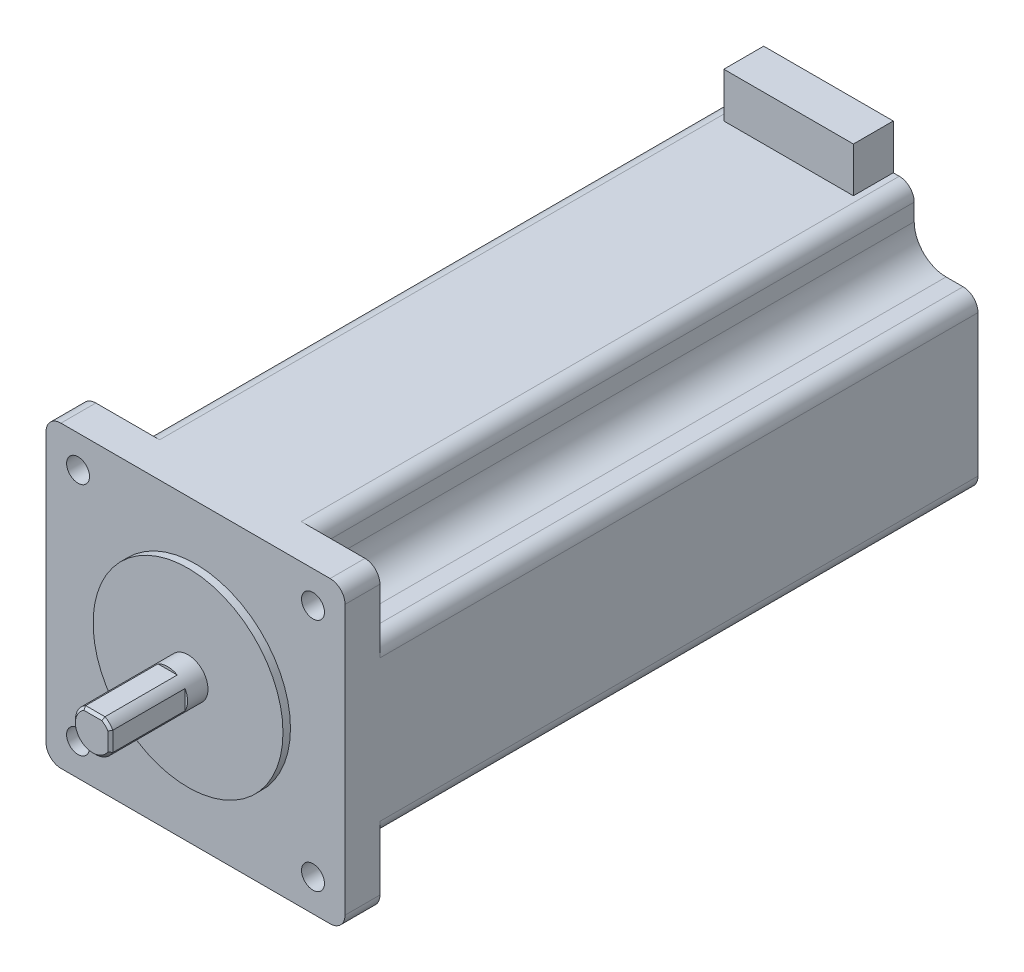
ISO-10303-21;
HEADER;
FILE_DESCRIPTION(('STEP AP214'),'2;1');
FILE_NAME('part.step','',(''),(''),'','','');
FILE_SCHEMA(('AUTOMOTIVE_DESIGN { 1 0 10303 214 1 1 1 1 }'));
ENDSEC;
DATA;
#1=APPLICATION_CONTEXT('core data for automotive mechanical design processes');
#2=APPLICATION_PROTOCOL_DEFINITION('international standard','automotive_design',2000,#1);
#3=PRODUCT_CONTEXT('',#1,'mechanical');
#4=PRODUCT('Part','Part','',(#3));
#5=PRODUCT_RELATED_PRODUCT_CATEGORY('part','',(#4));
#6=PRODUCT_DEFINITION_FORMATION('','',#4);
#7=PRODUCT_DEFINITION_CONTEXT('part definition',#1,'design');
#8=PRODUCT_DEFINITION('design','',#6,#7);
#9=PRODUCT_DEFINITION_SHAPE('','',#8);
#10=(LENGTH_UNIT() NAMED_UNIT(*) SI_UNIT(.MILLI.,.METRE.));
#11=(NAMED_UNIT(*) PLANE_ANGLE_UNIT() SI_UNIT($,.RADIAN.));
#12=(NAMED_UNIT(*) SI_UNIT($,.STERADIAN.) SOLID_ANGLE_UNIT());
#13=UNCERTAINTY_MEASURE_WITH_UNIT(LENGTH_MEASURE(1.E-05),#10,'distance_accuracy_value','');
#14=(GEOMETRIC_REPRESENTATION_CONTEXT(3) GLOBAL_UNCERTAINTY_ASSIGNED_CONTEXT((#13)) GLOBAL_UNIT_ASSIGNED_CONTEXT((#10,
#11,#12)) REPRESENTATION_CONTEXT('',''));
#15=CARTESIAN_POINT('',(0.,0.,0.));
#16=DIRECTION('',(0.,0.,1.));
#17=DIRECTION('',(1.,0.,0.));
#18=AXIS2_PLACEMENT_3D('',#15,#16,#17);
#19=CARTESIAN_POINT('',(13.,39.,-120.5));
#20=DIRECTION('',(1.,0.,0.));
#21=DIRECTION('',(0.,0.,-1.));
#22=AXIS2_PLACEMENT_3D('',#19,#20,#21);
#23=PLANE('',#22);
#24=DIRECTION('',(0.,-1.,0.));
#25=VECTOR('',#24,1.);
#26=CARTESIAN_POINT('',(13.,39.,-128.5));
#27=LINE('',#26,#25);
#28=CARTESIAN_POINT('',(13.,39.,-128.5));
#29=VERTEX_POINT('',#28);
#30=CARTESIAN_POINT('',(13.,30.,-128.5));
#31=VERTEX_POINT('',#30);
#32=EDGE_CURVE('E106',#29,#31,#27,.T.);
#33=ORIENTED_EDGE('',*,*,#32,.F.);
#34=DIRECTION('',(0.,0.,-1.));
#35=VECTOR('',#34,1.);
#36=CARTESIAN_POINT('',(13.,39.,-120.5));
#37=LINE('',#36,#35);
#38=CARTESIAN_POINT('',(13.,39.,-120.5));
#39=VERTEX_POINT('',#38);
#40=EDGE_CURVE('E55',#39,#29,#37,.T.);
#41=ORIENTED_EDGE('',*,*,#40,.F.);
#42=DIRECTION('',(0.,-1.,0.));
#43=VECTOR('',#42,1.);
#44=CARTESIAN_POINT('',(13.,39.,-120.5));
#45=LINE('',#44,#43);
#46=CARTESIAN_POINT('',(13.,30.,-120.5));
#47=VERTEX_POINT('',#46);
#48=EDGE_CURVE('E102',#39,#47,#45,.T.);
#49=ORIENTED_EDGE('',*,*,#48,.T.);
#50=DIRECTION('',(0.,0.,-1.));
#51=VECTOR('',#50,1.);
#52=CARTESIAN_POINT('',(13.,30.,-120.5));
#53=LINE('',#52,#51);
#54=EDGE_CURVE('E12',#47,#31,#53,.T.);
#55=ORIENTED_EDGE('',*,*,#54,.T.);
#56=EDGE_LOOP('',(#33,#41,#49,#55));
#57=FACE_BOUND('',#56,.T.);
#58=ADVANCED_FACE('F45',(#57),#23,.T.);
#59=CARTESIAN_POINT('',(-13.,39.,-120.5));
#60=DIRECTION('',(0.,1.,0.));
#61=DIRECTION('',(0.,0.,1.));
#62=AXIS2_PLACEMENT_3D('',#59,#60,#61);
#63=PLANE('',#62);
#64=DIRECTION('',(1.,0.,0.));
#65=VECTOR('',#64,1.);
#66=CARTESIAN_POINT('',(-13.,39.,-128.5));
#67=LINE('',#66,#65);
#68=CARTESIAN_POINT('',(-13.,39.,-128.5));
#69=VERTEX_POINT('',#68);
#70=EDGE_CURVE('E92',#69,#29,#67,.T.);
#71=ORIENTED_EDGE('',*,*,#70,.F.);
#72=DIRECTION('',(0.,0.,-1.));
#73=VECTOR('',#72,1.);
#74=CARTESIAN_POINT('',(-13.,39.,-120.5));
#75=LINE('',#74,#73);
#76=CARTESIAN_POINT('',(-13.,39.,-120.5));
#77=VERTEX_POINT('',#76);
#78=EDGE_CURVE('E87',#77,#69,#75,.T.);
#79=ORIENTED_EDGE('',*,*,#78,.F.);
#80=DIRECTION('',(1.,0.,0.));
#81=VECTOR('',#80,1.);
#82=CARTESIAN_POINT('',(-13.,39.,-120.5));
#83=LINE('',#82,#81);
#84=EDGE_CURVE('E90',#77,#39,#83,.T.);
#85=ORIENTED_EDGE('',*,*,#84,.T.);
#86=ORIENTED_EDGE('',*,*,#40,.T.);
#87=EDGE_LOOP('',(#71,#79,#85,#86));
#88=FACE_BOUND('',#87,.T.);
#89=ADVANCED_FACE('F89',(#88),#63,.T.);
#90=CARTESIAN_POINT('',(-13.,30.,-120.5));
#91=DIRECTION('',(-1.,0.,0.));
#92=DIRECTION('',(0.,0.,1.));
#93=AXIS2_PLACEMENT_3D('',#90,#91,#92);
#94=PLANE('',#93);
#95=DIRECTION('',(0.,1.,0.));
#96=VECTOR('',#95,1.);
#97=CARTESIAN_POINT('',(-13.,30.,-128.5));
#98=LINE('',#97,#96);
#99=CARTESIAN_POINT('',(-13.,30.,-128.5));
#100=VERTEX_POINT('',#99);
#101=EDGE_CURVE('E111',#100,#69,#98,.T.);
#102=ORIENTED_EDGE('',*,*,#101,.F.);
#103=DIRECTION('',(0.,0.,-1.));
#104=VECTOR('',#103,1.);
#105=CARTESIAN_POINT('',(-13.,30.,-120.5));
#106=LINE('',#105,#104);
#107=CARTESIAN_POINT('',(-13.,30.,-120.5));
#108=VERTEX_POINT('',#107);
#109=EDGE_CURVE('E49',#108,#100,#106,.T.);
#110=ORIENTED_EDGE('',*,*,#109,.F.);
#111=DIRECTION('',(0.,1.,0.));
#112=VECTOR('',#111,1.);
#113=CARTESIAN_POINT('',(-13.,30.,-120.5));
#114=LINE('',#113,#112);
#115=EDGE_CURVE('E100',#108,#77,#114,.T.);
#116=ORIENTED_EDGE('',*,*,#115,.T.);
#117=ORIENTED_EDGE('',*,*,#78,.T.);
#118=EDGE_LOOP('',(#102,#110,#116,#117));
#119=FACE_BOUND('',#118,.T.);
#120=ADVANCED_FACE('F104',(#119),#94,.T.);
#121=CARTESIAN_POINT('',(0.,30.,-120.5));
#122=DIRECTION('',(0.,-1.,0.));
#123=DIRECTION('',(1.,0.,0.));
#124=AXIS2_PLACEMENT_3D('',#121,#122,#123);
#125=PLANE('',#124);
#126=DIRECTION('',(-1.,0.,0.));
#127=VECTOR('',#126,1.);
#128=CARTESIAN_POINT('',(0.,30.,-128.5));
#129=LINE('',#128,#127);
#130=EDGE_CURVE('E82',#31,#100,#129,.T.);
#131=ORIENTED_EDGE('',*,*,#130,.F.);
#132=ORIENTED_EDGE('',*,*,#54,.F.);
#133=DIRECTION('',(-1.,0.,0.));
#134=VECTOR('',#133,1.);
#135=CARTESIAN_POINT('',(13.,30.,-120.5));
#136=LINE('',#135,#134);
#137=EDGE_CURVE('E84',#47,#108,#136,.T.);
#138=ORIENTED_EDGE('',*,*,#137,.T.);
#139=ORIENTED_EDGE('',*,*,#109,.T.);
#140=EDGE_LOOP('',(#131,#132,#138,#139));
#141=FACE_BOUND('',#140,.T.);
#142=ADVANCED_FACE('F47',(#141),#125,.T.);
#143=CARTESIAN_POINT('',(0.,0.,-120.5));
#144=DIRECTION('',(0.,0.,-1.));
#145=DIRECTION('',(-1.,0.,0.));
#146=AXIS2_PLACEMENT_3D('',#143,#144,#145);
#147=PLANE('',#146);
#148=ORIENTED_EDGE('',*,*,#137,.F.);
#149=ORIENTED_EDGE('',*,*,#48,.F.);
#150=ORIENTED_EDGE('',*,*,#84,.F.);
#151=ORIENTED_EDGE('',*,*,#115,.F.);
#152=EDGE_LOOP('',(#148,#149,#150,#151));
#153=FACE_BOUND('',#152,.T.);
#154=ADVANCED_FACE('F99',(#153),#147,.F.);
#155=CARTESIAN_POINT('',(0.,0.,-128.5));
#156=DIRECTION('',(0.,0.,-1.));
#157=DIRECTION('',(-1.,0.,0.));
#158=AXIS2_PLACEMENT_3D('',#155,#156,#157);
#159=PLANE('',#158);
#160=ORIENTED_EDGE('',*,*,#32,.T.);
#161=ORIENTED_EDGE('',*,*,#130,.T.);
#162=ORIENTED_EDGE('',*,*,#101,.T.);
#163=ORIENTED_EDGE('',*,*,#70,.T.);
#164=EDGE_LOOP('',(#160,#161,#162,#163));
#165=FACE_BOUND('',#164,.T.);
#166=ADVANCED_FACE('F118',(#165),#159,.T.);
#167=CLOSED_SHELL('',(#58,#89,#120,#142,#154,#166));
#168=MANIFOLD_SOLID_BREP('B2',#167);
#169=CARTESIAN_POINT('',(27.,-27.,-128.5));
#170=DIRECTION('',(0.,0.,1.));
#171=DIRECTION('',(1.,0.,0.));
#172=AXIS2_PLACEMENT_3D('',#169,#170,#171);
#173=CYLINDRICAL_SURFACE('',#172,3.);
#174=CARTESIAN_POINT('',(27.,-27.,-8.50000000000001));
#175=DIRECTION('',(0.,0.,-1.));
#176=DIRECTION('',(-1.,0.,0.));
#177=AXIS2_PLACEMENT_3D('',#174,#175,#176);
#178=CIRCLE('',#177,3.);
#179=CARTESIAN_POINT('',(30.,-27.,-8.50000000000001));
#180=VERTEX_POINT('',#179);
#181=CARTESIAN_POINT('',(27.,-30.,-8.50000000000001));
#182=VERTEX_POINT('',#181);
#183=EDGE_CURVE('E470',#180,#182,#178,.T.);
#184=ORIENTED_EDGE('',*,*,#183,.F.);
#185=DIRECTION('',(0.,0.,1.));
#186=VECTOR('',#185,1.);
#187=CARTESIAN_POINT('',(30.,-27.,-128.5));
#188=LINE('',#187,#186);
#189=CARTESIAN_POINT('',(30.,-27.,-1.5));
#190=VERTEX_POINT('',#189);
#191=EDGE_CURVE('E645',#180,#190,#188,.T.);
#192=ORIENTED_EDGE('',*,*,#191,.T.);
#193=CARTESIAN_POINT('',(27.,-27.,-1.5));
#194=DIRECTION('',(0.,0.,-1.));
#195=DIRECTION('',(1.,0.,0.));
#196=AXIS2_PLACEMENT_3D('',#193,#194,#195);
#197=CIRCLE('',#196,3.);
#198=CARTESIAN_POINT('',(27.,-30.,-1.5));
#199=VERTEX_POINT('',#198);
#200=EDGE_CURVE('E635',#190,#199,#197,.T.);
#201=ORIENTED_EDGE('',*,*,#200,.T.);
#202=DIRECTION('',(0.,0.,1.));
#203=VECTOR('',#202,1.);
#204=CARTESIAN_POINT('',(27.,-30.,-128.5));
#205=LINE('',#204,#203);
#206=EDGE_CURVE('E681',#182,#199,#205,.T.);
#207=ORIENTED_EDGE('',*,*,#206,.F.);
#208=EDGE_LOOP('',(#184,#192,#201,#207));
#209=FACE_BOUND('',#208,.T.);
#210=ADVANCED_FACE('F172',(#209),#173,.T.);
#211=CARTESIAN_POINT('',(23.57,-23.57,-128.5));
#212=DIRECTION('',(0.,0.,1.));
#213=DIRECTION('',(1.,0.,0.));
#214=AXIS2_PLACEMENT_3D('',#211,#212,#213);
#215=CYLINDRICAL_SURFACE('',#214,2.3);
#216=CARTESIAN_POINT('',(23.57,-23.57,-1.5));
#217=DIRECTION('',(0.,0.,-1.));
#218=DIRECTION('',(-1.,0.,0.));
#219=AXIS2_PLACEMENT_3D('',#216,#217,#218);
#220=CIRCLE('',#219,2.3);
#221=CARTESIAN_POINT('',(21.27,-23.57,-1.5));
#222=VERTEX_POINT('',#221);
#223=EDGE_CURVE('E626',#222,#222,#220,.T.);
#224=ORIENTED_EDGE('',*,*,#223,.F.);
#225=EDGE_LOOP('',(#224));
#226=FACE_BOUND('',#225,.T.);
#227=CARTESIAN_POINT('',(23.57,-23.57,-8.50000000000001));
#228=DIRECTION('',(0.,0.,-1.));
#229=DIRECTION('',(-1.,0.,0.));
#230=AXIS2_PLACEMENT_3D('',#227,#228,#229);
#231=CIRCLE('',#230,2.3);
#232=CARTESIAN_POINT('',(21.27,-23.57,-8.50000000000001));
#233=VERTEX_POINT('',#232);
#234=EDGE_CURVE('E177',#233,#233,#231,.T.);
#235=ORIENTED_EDGE('',*,*,#234,.T.);
#236=EDGE_LOOP('',(#235));
#237=FACE_BOUND('',#236,.T.);
#238=ADVANCED_FACE('F894',(#226,#237),#215,.F.);
#239=CARTESIAN_POINT('',(-27.,-27.,-128.5));
#240=DIRECTION('',(0.,0.,1.));
#241=DIRECTION('',(1.,0.,0.));
#242=AXIS2_PLACEMENT_3D('',#239,#240,#241);
#243=CYLINDRICAL_SURFACE('',#242,3.);
#244=CARTESIAN_POINT('',(-27.,-27.,-8.50000000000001));
#245=DIRECTION('',(0.,0.,-1.));
#246=DIRECTION('',(-1.,0.,0.));
#247=AXIS2_PLACEMENT_3D('',#244,#245,#246);
#248=CIRCLE('',#247,3.);
#249=CARTESIAN_POINT('',(-27.,-30.,-8.50000000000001));
#250=VERTEX_POINT('',#249);
#251=CARTESIAN_POINT('',(-30.,-27.,-8.50000000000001));
#252=VERTEX_POINT('',#251);
#253=EDGE_CURVE('E198',#250,#252,#248,.T.);
#254=ORIENTED_EDGE('',*,*,#253,.F.);
#255=DIRECTION('',(0.,0.,1.));
#256=VECTOR('',#255,1.);
#257=CARTESIAN_POINT('',(-27.,-30.,-128.5));
#258=LINE('',#257,#256);
#259=CARTESIAN_POINT('',(-27.,-30.,-1.5));
#260=VERTEX_POINT('',#259);
#261=EDGE_CURVE('E679',#250,#260,#258,.T.);
#262=ORIENTED_EDGE('',*,*,#261,.T.);
#263=CARTESIAN_POINT('',(-27.,-27.,-1.5));
#264=DIRECTION('',(0.,0.,-1.));
#265=DIRECTION('',(1.,0.,0.));
#266=AXIS2_PLACEMENT_3D('',#263,#264,#265);
#267=CIRCLE('',#266,3.);
#268=CARTESIAN_POINT('',(-30.,-27.,-1.5));
#269=VERTEX_POINT('',#268);
#270=EDGE_CURVE('E651',#260,#269,#267,.T.);
#271=ORIENTED_EDGE('',*,*,#270,.T.);
#272=DIRECTION('',(0.,0.,1.));
#273=VECTOR('',#272,1.);
#274=CARTESIAN_POINT('',(-30.,-27.,-128.5));
#275=LINE('',#274,#273);
#276=EDGE_CURVE('E677',#252,#269,#275,.T.);
#277=ORIENTED_EDGE('',*,*,#276,.F.);
#278=EDGE_LOOP('',(#254,#262,#271,#277));
#279=FACE_BOUND('',#278,.T.);
#280=ADVANCED_FACE('F785',(#279),#243,.T.);
#281=CARTESIAN_POINT('',(-23.57,-23.57,-128.5));
#282=DIRECTION('',(0.,0.,1.));
#283=DIRECTION('',(1.,0.,0.));
#284=AXIS2_PLACEMENT_3D('',#281,#282,#283);
#285=CYLINDRICAL_SURFACE('',#284,2.3);
#286=CARTESIAN_POINT('',(-23.57,-23.57,-1.5));
#287=DIRECTION('',(0.,0.,-1.));
#288=DIRECTION('',(-1.,0.,0.));
#289=AXIS2_PLACEMENT_3D('',#286,#287,#288);
#290=CIRCLE('',#289,2.3);
#291=CARTESIAN_POINT('',(-25.87,-23.57,-1.5));
#292=VERTEX_POINT('',#291);
#293=EDGE_CURVE('E629',#292,#292,#290,.T.);
#294=ORIENTED_EDGE('',*,*,#293,.F.);
#295=EDGE_LOOP('',(#294));
#296=FACE_BOUND('',#295,.T.);
#297=CARTESIAN_POINT('',(-23.57,-23.57,-8.50000000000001));
#298=DIRECTION('',(0.,0.,-1.));
#299=DIRECTION('',(-1.,0.,0.));
#300=AXIS2_PLACEMENT_3D('',#297,#298,#299);
#301=CIRCLE('',#300,2.3);
#302=CARTESIAN_POINT('',(-25.87,-23.57,-8.50000000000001));
#303=VERTEX_POINT('',#302);
#304=EDGE_CURVE('E507',#303,#303,#301,.T.);
#305=ORIENTED_EDGE('',*,*,#304,.T.);
#306=EDGE_LOOP('',(#305));
#307=FACE_BOUND('',#306,.T.);
#308=ADVANCED_FACE('F772',(#296,#307),#285,.F.);
#309=CARTESIAN_POINT('',(27.,27.,-128.5));
#310=DIRECTION('',(0.,0.,1.));
#311=DIRECTION('',(1.,0.,0.));
#312=AXIS2_PLACEMENT_3D('',#309,#310,#311);
#313=CYLINDRICAL_SURFACE('',#312,3.);
#314=CARTESIAN_POINT('',(27.,27.,-8.50000000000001));
#315=DIRECTION('',(0.,0.,-1.));
#316=DIRECTION('',(-1.,0.,0.));
#317=AXIS2_PLACEMENT_3D('',#314,#315,#316);
#318=CIRCLE('',#317,3.);
#319=CARTESIAN_POINT('',(27.,30.,-8.50000000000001));
#320=VERTEX_POINT('',#319);
#321=CARTESIAN_POINT('',(30.,27.,-8.50000000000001));
#322=VERTEX_POINT('',#321);
#323=EDGE_CURVE('E569',#320,#322,#318,.T.);
#324=ORIENTED_EDGE('',*,*,#323,.F.);
#325=DIRECTION('',(0.,0.,1.));
#326=VECTOR('',#325,1.);
#327=CARTESIAN_POINT('',(27.,30.,-128.5));
#328=LINE('',#327,#326);
#329=CARTESIAN_POINT('',(27.,30.,-1.5));
#330=VERTEX_POINT('',#329);
#331=EDGE_CURVE('E671',#320,#330,#328,.T.);
#332=ORIENTED_EDGE('',*,*,#331,.T.);
#333=CARTESIAN_POINT('',(27.,27.,-1.5));
#334=DIRECTION('',(0.,0.,-1.));
#335=DIRECTION('',(1.,0.,0.));
#336=AXIS2_PLACEMENT_3D('',#333,#334,#335);
#337=CIRCLE('',#336,3.);
#338=CARTESIAN_POINT('',(30.,27.,-1.5));
#339=VERTEX_POINT('',#338);
#340=EDGE_CURVE('E663',#330,#339,#337,.T.);
#341=ORIENTED_EDGE('',*,*,#340,.T.);
#342=DIRECTION('',(0.,0.,1.));
#343=VECTOR('',#342,1.);
#344=CARTESIAN_POINT('',(30.,27.,-128.5));
#345=LINE('',#344,#343);
#346=EDGE_CURVE('E669',#322,#339,#345,.T.);
#347=ORIENTED_EDGE('',*,*,#346,.F.);
#348=EDGE_LOOP('',(#324,#332,#341,#347));
#349=FACE_BOUND('',#348,.T.);
#350=ADVANCED_FACE('F848',(#349),#313,.T.);
#351=CARTESIAN_POINT('',(23.57,23.57,-128.5));
#352=DIRECTION('',(0.,0.,1.));
#353=DIRECTION('',(1.,0.,0.));
#354=AXIS2_PLACEMENT_3D('',#351,#352,#353);
#355=CYLINDRICAL_SURFACE('',#354,2.3);
#356=CARTESIAN_POINT('',(23.57,23.57,-1.5));
#357=DIRECTION('',(0.,0.,-1.));
#358=DIRECTION('',(-1.,0.,0.));
#359=AXIS2_PLACEMENT_3D('',#356,#357,#358);
#360=CIRCLE('',#359,2.3);
#361=CARTESIAN_POINT('',(21.27,23.57,-1.5));
#362=VERTEX_POINT('',#361);
#363=EDGE_CURVE('E623',#362,#362,#360,.T.);
#364=ORIENTED_EDGE('',*,*,#363,.F.);
#365=EDGE_LOOP('',(#364));
#366=FACE_BOUND('',#365,.T.);
#367=CARTESIAN_POINT('',(23.57,23.57,-8.50000000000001));
#368=DIRECTION('',(0.,0.,-1.));
#369=DIRECTION('',(-1.,0.,0.));
#370=AXIS2_PLACEMENT_3D('',#367,#368,#369);
#371=CIRCLE('',#370,2.3);
#372=CARTESIAN_POINT('',(21.27,23.57,-8.50000000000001));
#373=VERTEX_POINT('',#372);
#374=EDGE_CURVE('E556',#373,#373,#371,.T.);
#375=ORIENTED_EDGE('',*,*,#374,.T.);
#376=EDGE_LOOP('',(#375));
#377=FACE_BOUND('',#376,.T.);
#378=ADVANCED_FACE('F977',(#366,#377),#355,.F.);
#379=CARTESIAN_POINT('',(-27.,27.,-128.5));
#380=DIRECTION('',(0.,0.,1.));
#381=DIRECTION('',(1.,0.,0.));
#382=AXIS2_PLACEMENT_3D('',#379,#380,#381);
#383=CYLINDRICAL_SURFACE('',#382,3.);
#384=CARTESIAN_POINT('',(-27.,27.,-8.50000000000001));
#385=DIRECTION('',(0.,0.,-1.));
#386=DIRECTION('',(-1.,0.,0.));
#387=AXIS2_PLACEMENT_3D('',#384,#385,#386);
#388=CIRCLE('',#387,3.);
#389=CARTESIAN_POINT('',(-30.,27.,-8.50000000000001));
#390=VERTEX_POINT('',#389);
#391=CARTESIAN_POINT('',(-27.,30.,-8.50000000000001));
#392=VERTEX_POINT('',#391);
#393=EDGE_CURVE('E619',#390,#392,#388,.T.);
#394=ORIENTED_EDGE('',*,*,#393,.F.);
#395=DIRECTION('',(0.,0.,1.));
#396=VECTOR('',#395,1.);
#397=CARTESIAN_POINT('',(-30.,27.,-128.5));
#398=LINE('',#397,#396);
#399=CARTESIAN_POINT('',(-30.,27.,-1.5));
#400=VERTEX_POINT('',#399);
#401=EDGE_CURVE('E675',#390,#400,#398,.T.);
#402=ORIENTED_EDGE('',*,*,#401,.T.);
#403=CARTESIAN_POINT('',(-27.,27.,-1.5));
#404=DIRECTION('',(0.,0.,-1.));
#405=DIRECTION('',(1.,0.,0.));
#406=AXIS2_PLACEMENT_3D('',#403,#404,#405);
#407=CIRCLE('',#406,3.);
#408=CARTESIAN_POINT('',(-27.,30.,-1.5));
#409=VERTEX_POINT('',#408);
#410=EDGE_CURVE('E657',#400,#409,#407,.T.);
#411=ORIENTED_EDGE('',*,*,#410,.T.);
#412=DIRECTION('',(0.,0.,1.));
#413=VECTOR('',#412,1.);
#414=CARTESIAN_POINT('',(-27.,30.,-128.5));
#415=LINE('',#414,#413);
#416=EDGE_CURVE('E673',#392,#409,#415,.T.);
#417=ORIENTED_EDGE('',*,*,#416,.F.);
#418=EDGE_LOOP('',(#394,#402,#411,#417));
#419=FACE_BOUND('',#418,.T.);
#420=ADVANCED_FACE('F857',(#419),#383,.T.);
#421=CARTESIAN_POINT('',(-23.57,23.57,-128.5));
#422=DIRECTION('',(0.,0.,1.));
#423=DIRECTION('',(1.,0.,0.));
#424=AXIS2_PLACEMENT_3D('',#421,#422,#423);
#425=CYLINDRICAL_SURFACE('',#424,2.3);
#426=CARTESIAN_POINT('',(-23.57,23.57,-1.5));
#427=DIRECTION('',(0.,0.,-1.));
#428=DIRECTION('',(-1.,0.,0.));
#429=AXIS2_PLACEMENT_3D('',#426,#427,#428);
#430=CIRCLE('',#429,2.3);
#431=CARTESIAN_POINT('',(-25.87,23.57,-1.5));
#432=VERTEX_POINT('',#431);
#433=EDGE_CURVE('E632',#432,#432,#430,.T.);
#434=ORIENTED_EDGE('',*,*,#433,.F.);
#435=EDGE_LOOP('',(#434));
#436=FACE_BOUND('',#435,.T.);
#437=CARTESIAN_POINT('',(-23.57,23.57,-8.50000000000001));
#438=DIRECTION('',(0.,0.,-1.));
#439=DIRECTION('',(-1.,0.,0.));
#440=AXIS2_PLACEMENT_3D('',#437,#438,#439);
#441=CIRCLE('',#440,2.3);
#442=CARTESIAN_POINT('',(-25.87,23.57,-8.50000000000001));
#443=VERTEX_POINT('',#442);
#444=EDGE_CURVE('E606',#443,#443,#441,.T.);
#445=ORIENTED_EDGE('',*,*,#444,.T.);
#446=EDGE_LOOP('',(#445));
#447=FACE_BOUND('',#446,.T.);
#448=ADVANCED_FACE('F931',(#436,#447),#425,.F.);
#449=CARTESIAN_POINT('',(0.,0.,0.));
#450=DIRECTION('',(0.,0.,1.));
#451=DIRECTION('',(1.,0.,0.));
#452=AXIS2_PLACEMENT_3D('',#449,#450,#451);
#453=PLANE('',#452);
#454=CARTESIAN_POINT('',(0.,0.,0.));
#455=DIRECTION('',(0.,0.,1.));
#456=DIRECTION('',(1.,0.,0.));
#457=AXIS2_PLACEMENT_3D('',#454,#455,#456);
#458=CIRCLE('',#457,19.05);
#459=CARTESIAN_POINT('',(19.05,0.,0.));
#460=VERTEX_POINT('',#459);
#461=EDGE_CURVE('E707',#460,#460,#458,.T.);
#462=ORIENTED_EDGE('',*,*,#461,.T.);
#463=EDGE_LOOP('',(#462));
#464=FACE_BOUND('',#463,.T.);
#465=CARTESIAN_POINT('',(0.,0.,0.));
#466=DIRECTION('',(0.,0.,1.));
#467=DIRECTION('',(1.,0.,0.));
#468=AXIS2_PLACEMENT_3D('',#465,#466,#467);
#469=CIRCLE('',#468,4.);
#470=CARTESIAN_POINT('',(4.,0.,0.));
#471=VERTEX_POINT('',#470);
#472=EDGE_CURVE('E704',#471,#471,#469,.T.);
#473=ORIENTED_EDGE('',*,*,#472,.F.);
#474=EDGE_LOOP('',(#473));
#475=FACE_BOUND('',#474,.T.);
#476=ADVANCED_FACE('F929',(#464,#475),#453,.T.);
#477=CARTESIAN_POINT('',(0.,0.,-1.5));
#478=DIRECTION('',(0.,0.,1.));
#479=DIRECTION('',(1.,0.,0.));
#480=AXIS2_PLACEMENT_3D('',#477,#478,#479);
#481=CYLINDRICAL_SURFACE('',#480,19.05);
#482=CARTESIAN_POINT('',(0.,0.,-1.5));
#483=DIRECTION('',(0.,0.,1.));
#484=DIRECTION('',(1.,0.,0.));
#485=AXIS2_PLACEMENT_3D('',#482,#483,#484);
#486=CIRCLE('',#485,19.05);
#487=CARTESIAN_POINT('',(19.05,0.,-1.5));
#488=VERTEX_POINT('',#487);
#489=EDGE_CURVE('E683',#488,#488,#486,.F.);
#490=ORIENTED_EDGE('',*,*,#489,.F.);
#491=EDGE_LOOP('',(#490));
#492=FACE_BOUND('',#491,.T.);
#493=ORIENTED_EDGE('',*,*,#461,.F.);
#494=EDGE_LOOP('',(#493));
#495=FACE_BOUND('',#494,.T.);
#496=ADVANCED_FACE('F927',(#492,#495),#481,.T.);
#497=CARTESIAN_POINT('',(0.,0.,19.1));
#498=DIRECTION('',(0.,0.,-1.));
#499=DIRECTION('',(-1.,0.,0.));
#500=AXIS2_PLACEMENT_3D('',#497,#498,#499);
#501=CYLINDRICAL_SURFACE('',#500,4.);
#502=DIRECTION('',(0.,0.,-1.));
#503=VECTOR('',#502,1.);
#504=CARTESIAN_POINT('',(1.93649167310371,3.5,19.1));
#505=LINE('',#504,#503);
#506=CARTESIAN_POINT('',(1.93649167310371,3.5,4.1));
#507=VERTEX_POINT('',#506);
#508=CARTESIAN_POINT('',(1.93649167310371,3.5,18.6));
#509=VERTEX_POINT('',#508);
#510=EDGE_CURVE('E699',#507,#509,#505,.F.);
#511=ORIENTED_EDGE('',*,*,#510,.T.);
#512=CARTESIAN_POINT('',(0.,0.,18.6));
#513=DIRECTION('',(0.,0.,1.));
#514=DIRECTION('',(1.,0.,0.));
#515=AXIS2_PLACEMENT_3D('',#512,#513,#514);
#516=CIRCLE('',#515,4.);
#517=CARTESIAN_POINT('',(3.5,1.93649167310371,18.6));
#518=VERTEX_POINT('',#517);
#519=EDGE_CURVE('E182',#509,#518,#516,.F.);
#520=ORIENTED_EDGE('',*,*,#519,.T.);
#521=DIRECTION('',(0.,0.,-1.));
#522=VECTOR('',#521,1.);
#523=CARTESIAN_POINT('',(3.5,1.93649167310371,19.1));
#524=LINE('',#523,#522);
#525=CARTESIAN_POINT('',(3.5,1.93649167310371,4.1));
#526=VERTEX_POINT('',#525);
#527=EDGE_CURVE('E694',#518,#526,#524,.T.);
#528=ORIENTED_EDGE('',*,*,#527,.T.);
#529=CARTESIAN_POINT('',(0.,0.,4.1));
#530=DIRECTION('',(0.,0.,1.));
#531=DIRECTION('',(1.,0.,0.));
#532=AXIS2_PLACEMENT_3D('',#529,#530,#531);
#533=CIRCLE('',#532,4.);
#534=CARTESIAN_POINT('',(3.5,-1.93649167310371,4.1));
#535=VERTEX_POINT('',#534);
#536=EDGE_CURVE('E713',#535,#526,#533,.T.);
#537=ORIENTED_EDGE('',*,*,#536,.F.);
#538=DIRECTION('',(0.,0.,-1.));
#539=VECTOR('',#538,1.);
#540=CARTESIAN_POINT('',(3.5,-1.93649167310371,19.1));
#541=LINE('',#540,#539);
#542=CARTESIAN_POINT('',(3.5,-1.93649167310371,18.6));
#543=VERTEX_POINT('',#542);
#544=EDGE_CURVE('E690',#535,#543,#541,.F.);
#545=ORIENTED_EDGE('',*,*,#544,.T.);
#546=CARTESIAN_POINT('',(0.,0.,18.6));
#547=DIRECTION('',(0.,0.,1.));
#548=DIRECTION('',(1.,0.,0.));
#549=AXIS2_PLACEMENT_3D('',#546,#547,#548);
#550=CIRCLE('',#549,4.);
#551=CARTESIAN_POINT('',(-1.93649167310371,3.5,18.6));
#552=VERTEX_POINT('',#551);
#553=EDGE_CURVE('E728',#543,#552,#550,.F.);
#554=ORIENTED_EDGE('',*,*,#553,.T.);
#555=DIRECTION('',(0.,0.,-1.));
#556=VECTOR('',#555,1.);
#557=CARTESIAN_POINT('',(-1.93649167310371,3.5,19.1));
#558=LINE('',#557,#556);
#559=CARTESIAN_POINT('',(-1.93649167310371,3.5,4.1));
#560=VERTEX_POINT('',#559);
#561=EDGE_CURVE('E702',#552,#560,#558,.T.);
#562=ORIENTED_EDGE('',*,*,#561,.T.);
#563=CARTESIAN_POINT('',(0.,0.,4.1));
#564=DIRECTION('',(0.,0.,1.));
#565=DIRECTION('',(1.,0.,0.));
#566=AXIS2_PLACEMENT_3D('',#563,#564,#565);
#567=CIRCLE('',#566,4.);
#568=EDGE_CURVE('E710',#507,#560,#567,.T.);
#569=ORIENTED_EDGE('',*,*,#568,.F.);
#570=EDGE_LOOP('',(#511,#520,#528,#537,#545,#554,#562,#569));
#571=FACE_BOUND('',#570,.T.);
#572=ORIENTED_EDGE('',*,*,#472,.T.);
#573=EDGE_LOOP('',(#572));
#574=FACE_BOUND('',#573,.T.);
#575=ADVANCED_FACE('F923',(#571,#574),#501,.T.);
#576=CARTESIAN_POINT('',(0.,0.,19.1));
#577=DIRECTION('',(0.,0.,1.));
#578=DIRECTION('',(1.,0.,0.));
#579=AXIS2_PLACEMENT_3D('',#576,#577,#578);
#580=PLANE('',#579);
#581=CARTESIAN_POINT('',(0.,0.,19.1));
#582=DIRECTION('',(0.,0.,1.));
#583=DIRECTION('',(1.,0.,0.));
#584=AXIS2_PLACEMENT_3D('',#581,#582,#583);
#585=CIRCLE('',#584,3.49999999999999);
#586=CARTESIAN_POINT('',(2.99999999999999,1.8027756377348,19.1));
#587=VERTEX_POINT('',#586);
#588=CARTESIAN_POINT('',(1.8027756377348,2.99999999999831,19.1));
#589=VERTEX_POINT('',#588);
#590=EDGE_CURVE('E723',#587,#589,#585,.T.);
#591=ORIENTED_EDGE('',*,*,#590,.T.);
#592=DIRECTION('',(-1.,0.,0.));
#593=VECTOR('',#592,1.);
#594=CARTESIAN_POINT('',(-1.93649167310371,2.99999999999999,19.1));
#595=LINE('',#594,#593);
#596=CARTESIAN_POINT('',(-1.8027756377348,2.99999999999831,19.1));
#597=VERTEX_POINT('',#596);
#598=EDGE_CURVE('E725',#589,#597,#595,.T.);
#599=ORIENTED_EDGE('',*,*,#598,.T.);
#600=CARTESIAN_POINT('',(0.,0.,19.1));
#601=DIRECTION('',(0.,0.,1.));
#602=DIRECTION('',(1.,0.,0.));
#603=AXIS2_PLACEMENT_3D('',#600,#601,#602);
#604=CIRCLE('',#603,3.49999999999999);
#605=CARTESIAN_POINT('',(2.99999999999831,-1.8027756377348,19.1));
#606=VERTEX_POINT('',#605);
#607=EDGE_CURVE('E719',#597,#606,#604,.T.);
#608=ORIENTED_EDGE('',*,*,#607,.T.);
#609=DIRECTION('',(0.,1.,0.));
#610=VECTOR('',#609,1.);
#611=CARTESIAN_POINT('',(2.99999999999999,1.93649167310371,19.1));
#612=LINE('',#611,#610);
#613=EDGE_CURVE('E721',#606,#587,#612,.T.);
#614=ORIENTED_EDGE('',*,*,#613,.T.);
#615=EDGE_LOOP('',(#591,#599,#608,#614));
#616=FACE_BOUND('',#615,.T.);
#617=ADVANCED_FACE('F916',(#616),#580,.T.);
#618=CARTESIAN_POINT('',(0.,0.,4.1));
#619=DIRECTION('',(0.,0.,1.));
#620=DIRECTION('',(1.,0.,0.));
#621=AXIS2_PLACEMENT_3D('',#618,#619,#620);
#622=PLANE('',#621);
#623=ORIENTED_EDGE('',*,*,#568,.T.);
#624=DIRECTION('',(1.,0.,0.));
#625=VECTOR('',#624,1.);
#626=CARTESIAN_POINT('',(-4.,3.5,4.1));
#627=LINE('',#626,#625);
#628=EDGE_CURVE('E696',#560,#507,#627,.T.);
#629=ORIENTED_EDGE('',*,*,#628,.T.);
#630=EDGE_LOOP('',(#623,#629));
#631=FACE_BOUND('',#630,.T.);
#632=ADVANCED_FACE('F913',(#631),#622,.T.);
#633=CARTESIAN_POINT('',(0.,3.5,4.1));
#634=DIRECTION('',(0.,-1.,0.));
#635=DIRECTION('',(0.,0.,-1.));
#636=AXIS2_PLACEMENT_3D('',#633,#634,#635);
#637=PLANE('',#636);
#638=ORIENTED_EDGE('',*,*,#561,.F.);
#639=DIRECTION('',(1.,0.,0.));
#640=VECTOR('',#639,1.);
#641=CARTESIAN_POINT('',(1.93649167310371,3.5,18.6));
#642=LINE('',#641,#640);
#643=EDGE_CURVE('E716',#552,#509,#642,.T.);
#644=ORIENTED_EDGE('',*,*,#643,.T.);
#645=ORIENTED_EDGE('',*,*,#510,.F.);
#646=ORIENTED_EDGE('',*,*,#628,.F.);
#647=EDGE_LOOP('',(#638,#644,#645,#646));
#648=FACE_BOUND('',#647,.T.);
#649=ADVANCED_FACE('F908',(#648),#637,.F.);
#650=CARTESIAN_POINT('',(0.,0.,4.1));
#651=DIRECTION('',(0.,0.,1.));
#652=DIRECTION('',(1.,0.,0.));
#653=AXIS2_PLACEMENT_3D('',#650,#651,#652);
#654=PLANE('',#653);
#655=ORIENTED_EDGE('',*,*,#536,.T.);
#656=DIRECTION('',(0.,-1.,0.));
#657=VECTOR('',#656,1.);
#658=CARTESIAN_POINT('',(3.5,3.5,4.1));
#659=LINE('',#658,#657);
#660=EDGE_CURVE('E687',#526,#535,#659,.T.);
#661=ORIENTED_EDGE('',*,*,#660,.T.);
#662=EDGE_LOOP('',(#655,#661));
#663=FACE_BOUND('',#662,.T.);
#664=ADVANCED_FACE('F904',(#663),#654,.T.);
#665=CARTESIAN_POINT('',(3.5,0.,4.1));
#666=DIRECTION('',(-1.,0.,0.));
#667=DIRECTION('',(0.,0.,1.));
#668=AXIS2_PLACEMENT_3D('',#665,#666,#667);
#669=PLANE('',#668);
#670=ORIENTED_EDGE('',*,*,#527,.F.);
#671=DIRECTION('',(0.,-1.,0.));
#672=VECTOR('',#671,1.);
#673=CARTESIAN_POINT('',(3.5,-1.93649167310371,18.6));
#674=LINE('',#673,#672);
#675=EDGE_CURVE('E43',#518,#543,#674,.T.);
#676=ORIENTED_EDGE('',*,*,#675,.T.);
#677=ORIENTED_EDGE('',*,*,#544,.F.);
#678=ORIENTED_EDGE('',*,*,#660,.F.);
#679=EDGE_LOOP('',(#670,#676,#677,#678));
#680=FACE_BOUND('',#679,.T.);
#681=ADVANCED_FACE('F907',(#680),#669,.F.);
#682=CARTESIAN_POINT('',(3.5,0.,18.6));
#683=DIRECTION('',(0.707106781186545,0.,0.70710678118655));
#684=DIRECTION('',(0.,1.,0.));
#685=AXIS2_PLACEMENT_3D('',#682,#683,#684);
#686=PLANE('',#685);
#687=CARTESIAN_POINT('',(3.5,1.93649167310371,18.6));
#688=CARTESIAN_POINT('',(3.41656387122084,1.91497488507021,18.6834361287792));
#689=CARTESIAN_POINT('',(3.33317916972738,1.89307349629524,18.7668208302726));
#690=CARTESIAN_POINT('',(3.16651250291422,1.84850148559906,18.9334874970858));
#691=CARTESIAN_POINT('',(3.08323053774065,1.82583086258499,19.0167694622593));
#692=CARTESIAN_POINT('',(2.99999999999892,1.80277563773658,19.1000000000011));
#693=B_SPLINE_CURVE_WITH_KNOTS('',3,(#687,#688,#689,#690,#691,#692),.UNSPECIFIED.,.F.,.F.,(4,2,
4),(0.,0.3598210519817,0.719642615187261),.UNSPECIFIED.);
#694=EDGE_CURVE('E762',#587,#518,#693,.F.);
#695=ORIENTED_EDGE('',*,*,#694,.F.);
#696=ORIENTED_EDGE('',*,*,#613,.F.);
#697=CARTESIAN_POINT('',(3.5,-1.93649167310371,18.6));
#698=CARTESIAN_POINT('',(3.416563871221,-1.91497488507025,18.683436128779));
#699=CARTESIAN_POINT('',(3.33317916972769,-1.89307349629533,18.7668208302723));
#700=CARTESIAN_POINT('',(3.16651250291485,-1.84850148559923,18.9334874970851));
#701=CARTESIAN_POINT('',(3.08323053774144,-1.8258308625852,19.0167694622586));
#702=CARTESIAN_POINT('',(2.99999999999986,-1.80277563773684,19.1000000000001));
#703=B_SPLINE_CURVE_WITH_KNOTS('',3,(#697,#698,#699,#700,#701,#702),.UNSPECIFIED.,.F.,.F.,(4,2,
4),(0.,0.359821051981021,0.719642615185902),.UNSPECIFIED.);
#704=EDGE_CURVE('E691',#543,#606,#703,.T.);
#705=ORIENTED_EDGE('',*,*,#704,.F.);
#706=ORIENTED_EDGE('',*,*,#675,.F.);
#707=EDGE_LOOP('',(#695,#696,#705,#706));
#708=FACE_BOUND('',#707,.T.);
#709=ADVANCED_FACE('F174',(#708),#686,.T.);
#710=CARTESIAN_POINT('',(0.,0.,19.1));
#711=DIRECTION('',(0.,0.,-1.));
#712=DIRECTION('',(-1.,0.,0.));
#713=AXIS2_PLACEMENT_3D('',#710,#711,#712);
#714=CONICAL_SURFACE('',#713,3.49999999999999,0.785398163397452);
#715=ORIENTED_EDGE('',*,*,#704,.T.);
#716=ORIENTED_EDGE('',*,*,#607,.F.);
#717=CARTESIAN_POINT('',(-1.80277563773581,2.99999999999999,19.1));
#718=CARTESIAN_POINT('',(-1.82583086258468,3.0832305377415,19.0167694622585));
#719=CARTESIAN_POINT('',(-1.84850148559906,3.16651250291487,18.9334874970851));
#720=CARTESIAN_POINT('',(-1.8930734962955,3.33317916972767,18.7668208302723));
#721=CARTESIAN_POINT('',(-1.91497488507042,3.41656387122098,18.683436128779));
#722=CARTESIAN_POINT('',(-1.93649167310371,3.5,18.6));
#723=B_SPLINE_CURVE_WITH_KNOTS('',3,(#717,#718,#719,#720,#721,#722),.UNSPECIFIED.,.F.,.F.,(4,2,
4),(0.,0.359821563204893,0.719642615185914),.UNSPECIFIED.);
#724=EDGE_CURVE('E737',#552,#597,#723,.F.);
#725=ORIENTED_EDGE('',*,*,#724,.F.);
#726=ORIENTED_EDGE('',*,*,#553,.F.);
#727=EDGE_LOOP('',(#715,#716,#725,#726));
#728=FACE_BOUND('',#727,.T.);
#729=ADVANCED_FACE('F750',(#728),#714,.T.);
#730=CARTESIAN_POINT('',(0.,0.,19.1));
#731=DIRECTION('',(0.,0.,-1.));
#732=DIRECTION('',(-1.,0.,0.));
#733=AXIS2_PLACEMENT_3D('',#730,#731,#732);
#734=CONICAL_SURFACE('',#733,3.49999999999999,0.785398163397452);
#735=ORIENTED_EDGE('',*,*,#694,.T.);
#736=ORIENTED_EDGE('',*,*,#519,.F.);
#737=CARTESIAN_POINT('',(1.93649167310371,3.5,18.6));
#738=CARTESIAN_POINT('',(1.91497488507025,3.416563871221,18.683436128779));
#739=CARTESIAN_POINT('',(1.89307349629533,3.33317916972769,18.7668208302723));
#740=CARTESIAN_POINT('',(1.84850148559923,3.16651250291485,18.9334874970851));
#741=CARTESIAN_POINT('',(1.8258308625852,3.08323053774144,19.0167694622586));
#742=CARTESIAN_POINT('',(1.80277563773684,2.99999999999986,19.1000000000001));
#743=B_SPLINE_CURVE_WITH_KNOTS('',3,(#737,#738,#739,#740,#741,#742),.UNSPECIFIED.,.F.,.F.,(4,2,
4),(0.,0.359821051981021,0.719642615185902),.UNSPECIFIED.);
#744=EDGE_CURVE('E686',#589,#509,#743,.F.);
#745=ORIENTED_EDGE('',*,*,#744,.F.);
#746=ORIENTED_EDGE('',*,*,#590,.F.);
#747=EDGE_LOOP('',(#735,#736,#745,#746));
#748=FACE_BOUND('',#747,.T.);
#749=ADVANCED_FACE('F742',(#748),#734,.T.);
#750=CARTESIAN_POINT('',(0.,3.5,18.6));
#751=DIRECTION('',(0.,0.707106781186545,0.70710678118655));
#752=DIRECTION('',(-1.,0.,0.));
#753=AXIS2_PLACEMENT_3D('',#750,#751,#752);
#754=PLANE('',#753);
#755=ORIENTED_EDGE('',*,*,#724,.T.);
#756=ORIENTED_EDGE('',*,*,#598,.F.);
#757=ORIENTED_EDGE('',*,*,#744,.T.);
#758=ORIENTED_EDGE('',*,*,#643,.F.);
#759=EDGE_LOOP('',(#755,#756,#757,#758));
#760=FACE_BOUND('',#759,.T.);
#761=ADVANCED_FACE('F745',(#760),#754,.T.);
#762=CARTESIAN_POINT('',(27.,-27.,-128.5));
#763=DIRECTION('',(0.,0.,1.));
#764=DIRECTION('',(1.,0.,0.));
#765=AXIS2_PLACEMENT_3D('',#762,#763,#764);
#766=PLANE('',#765);
#767=DIRECTION('',(0.,1.,0.));
#768=VECTOR('',#767,1.);
#769=CARTESIAN_POINT('',(17.2,-27.,-128.5));
#770=LINE('',#769,#768);
#771=CARTESIAN_POINT('',(17.2,-27.,-128.5));
#772=VERTEX_POINT('',#771);
#773=CARTESIAN_POINT('',(17.2,-23.6,-128.5));
#774=VERTEX_POINT('',#773);
#775=EDGE_CURVE('E440',#772,#774,#770,.T.);
#776=ORIENTED_EDGE('',*,*,#775,.F.);
#777=CARTESIAN_POINT('',(14.2,-27.,-128.5));
#778=DIRECTION('',(0.,0.,1.));
#779=DIRECTION('',(1.,0.,0.));
#780=AXIS2_PLACEMENT_3D('',#777,#778,#779);
#781=CIRCLE('',#780,2.99999999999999);
#782=CARTESIAN_POINT('',(14.2,-30.,-128.5));
#783=VERTEX_POINT('',#782);
#784=EDGE_CURVE('E443',#783,#772,#781,.T.);
#785=ORIENTED_EDGE('',*,*,#784,.F.);
#786=DIRECTION('',(-1.,0.,0.));
#787=VECTOR('',#786,1.);
#788=CARTESIAN_POINT('',(-27.,-30.,-128.5));
#789=LINE('',#788,#787);
#790=CARTESIAN_POINT('',(-14.2,-30.,-128.5));
#791=VERTEX_POINT('',#790);
#792=EDGE_CURVE('E636',#783,#791,#789,.T.);
#793=ORIENTED_EDGE('',*,*,#792,.T.);
#794=CARTESIAN_POINT('',(-14.2,-27.,-128.5));
#795=DIRECTION('',(0.,0.,1.));
#796=DIRECTION('',(-1.,0.,0.));
#797=AXIS2_PLACEMENT_3D('',#794,#795,#796);
#798=CIRCLE('',#797,3.);
#799=CARTESIAN_POINT('',(-17.2,-27.,-128.5));
#800=VERTEX_POINT('',#799);
#801=EDGE_CURVE('E474',#800,#791,#798,.T.);
#802=ORIENTED_EDGE('',*,*,#801,.F.);
#803=DIRECTION('',(0.,-1.,0.));
#804=VECTOR('',#803,1.);
#805=CARTESIAN_POINT('',(-17.2,-27.,-128.5));
#806=LINE('',#805,#804);
#807=CARTESIAN_POINT('',(-17.2,-23.6,-128.5));
#808=VERTEX_POINT('',#807);
#809=EDGE_CURVE('E479',#808,#800,#806,.T.);
#810=ORIENTED_EDGE('',*,*,#809,.F.);
#811=CARTESIAN_POINT('',(-23.6,-23.6,-128.5));
#812=DIRECTION('',(0.,0.,-1.));
#813=DIRECTION('',(1.,0.,0.));
#814=AXIS2_PLACEMENT_3D('',#811,#812,#813);
#815=CIRCLE('',#814,6.4);
#816=CARTESIAN_POINT('',(-23.6,-17.2,-128.5));
#817=VERTEX_POINT('',#816);
#818=EDGE_CURVE('E500',#817,#808,#815,.T.);
#819=ORIENTED_EDGE('',*,*,#818,.F.);
#820=DIRECTION('',(1.,0.,0.));
#821=VECTOR('',#820,1.);
#822=CARTESIAN_POINT('',(-23.6,-17.2,-128.5));
#823=LINE('',#822,#821);
#824=CARTESIAN_POINT('',(-27.,-17.2,-128.5));
#825=VERTEX_POINT('',#824);
#826=EDGE_CURVE('E497',#825,#817,#823,.T.);
#827=ORIENTED_EDGE('',*,*,#826,.F.);
#828=CARTESIAN_POINT('',(-27.,-14.2,-128.5));
#829=DIRECTION('',(0.,0.,1.));
#830=DIRECTION('',(-1.,0.,0.));
#831=AXIS2_PLACEMENT_3D('',#828,#829,#830);
#832=CIRCLE('',#831,3.);
#833=CARTESIAN_POINT('',(-30.,-14.2,-128.5));
#834=VERTEX_POINT('',#833);
#835=EDGE_CURVE('E494',#834,#825,#832,.T.);
#836=ORIENTED_EDGE('',*,*,#835,.F.);
#837=DIRECTION('',(0.,1.,0.));
#838=VECTOR('',#837,1.);
#839=CARTESIAN_POINT('',(-30.,27.,-128.5));
#840=LINE('',#839,#838);
#841=CARTESIAN_POINT('',(-30.,14.2,-128.5));
#842=VERTEX_POINT('',#841);
#843=EDGE_CURVE('E638',#834,#842,#840,.T.);
#844=ORIENTED_EDGE('',*,*,#843,.T.);
#845=CARTESIAN_POINT('',(-27.,14.2,-128.5));
#846=DIRECTION('',(0.,0.,1.));
#847=DIRECTION('',(1.,0.,0.));
#848=AXIS2_PLACEMENT_3D('',#845,#846,#847);
#849=CIRCLE('',#848,3.);
#850=CARTESIAN_POINT('',(-27.,17.2,-128.5));
#851=VERTEX_POINT('',#850);
#852=EDGE_CURVE('E596',#851,#842,#849,.T.);
#853=ORIENTED_EDGE('',*,*,#852,.F.);
#854=DIRECTION('',(-1.,0.,0.));
#855=VECTOR('',#854,1.);
#856=CARTESIAN_POINT('',(-23.6,17.2,-128.5));
#857=LINE('',#856,#855);
#858=CARTESIAN_POINT('',(-23.6,17.2,-128.5));
#859=VERTEX_POINT('',#858);
#860=EDGE_CURVE('E593',#859,#851,#857,.T.);
#861=ORIENTED_EDGE('',*,*,#860,.F.);
#862=CARTESIAN_POINT('',(-23.6,23.6,-128.5));
#863=DIRECTION('',(0.,0.,-1.));
#864=DIRECTION('',(-1.,0.,0.));
#865=AXIS2_PLACEMENT_3D('',#862,#863,#864);
#866=CIRCLE('',#865,6.4);
#867=CARTESIAN_POINT('',(-17.2,23.6,-128.5));
#868=VERTEX_POINT('',#867);
#869=EDGE_CURVE('E573',#868,#859,#866,.T.);
#870=ORIENTED_EDGE('',*,*,#869,.F.);
#871=DIRECTION('',(0.,-1.,0.));
#872=VECTOR('',#871,1.);
#873=CARTESIAN_POINT('',(-17.2,27.,-128.5));
#874=LINE('',#873,#872);
#875=CARTESIAN_POINT('',(-17.2,27.,-128.5));
#876=VERTEX_POINT('',#875);
#877=EDGE_CURVE('E578',#876,#868,#874,.T.);
#878=ORIENTED_EDGE('',*,*,#877,.F.);
#879=CARTESIAN_POINT('',(-14.2,27.,-128.5));
#880=DIRECTION('',(0.,0.,1.));
#881=DIRECTION('',(1.,0.,0.));
#882=AXIS2_PLACEMENT_3D('',#879,#880,#881);
#883=CIRCLE('',#882,3.);
#884=CARTESIAN_POINT('',(-14.2,30.,-128.5));
#885=VERTEX_POINT('',#884);
#886=EDGE_CURVE('E599',#885,#876,#883,.T.);
#887=ORIENTED_EDGE('',*,*,#886,.F.);
#888=DIRECTION('',(1.,0.,0.));
#889=VECTOR('',#888,1.);
#890=CARTESIAN_POINT('',(0.,30.,-128.5));
#891=LINE('',#890,#889);
#892=CARTESIAN_POINT('',(14.2,30.,-128.5));
#893=VERTEX_POINT('',#892);
#894=EDGE_CURVE('E641',#885,#893,#891,.T.);
#895=ORIENTED_EDGE('',*,*,#894,.T.);
#896=CARTESIAN_POINT('',(14.2,27.,-128.5));
#897=DIRECTION('',(0.,0.,1.));
#898=DIRECTION('',(-1.,0.,0.));
#899=AXIS2_PLACEMENT_3D('',#896,#897,#898);
#900=CIRCLE('',#899,2.99999999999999);
#901=CARTESIAN_POINT('',(17.2,27.,-128.5));
#902=VERTEX_POINT('',#901);
#903=EDGE_CURVE('E523',#902,#893,#900,.T.);
#904=ORIENTED_EDGE('',*,*,#903,.F.);
#905=DIRECTION('',(0.,1.,0.));
#906=VECTOR('',#905,1.);
#907=CARTESIAN_POINT('',(17.2,27.,-128.5));
#908=LINE('',#907,#906);
#909=CARTESIAN_POINT('',(17.2,23.6,-128.5));
#910=VERTEX_POINT('',#909);
#911=EDGE_CURVE('E528',#910,#902,#908,.T.);
#912=ORIENTED_EDGE('',*,*,#911,.F.);
#913=CARTESIAN_POINT('',(23.6,23.6,-128.5));
#914=DIRECTION('',(0.,0.,-1.));
#915=DIRECTION('',(1.,0.,0.));
#916=AXIS2_PLACEMENT_3D('',#913,#914,#915);
#917=CIRCLE('',#916,6.4);
#918=CARTESIAN_POINT('',(23.6,17.2,-128.5));
#919=VERTEX_POINT('',#918);
#920=EDGE_CURVE('E549',#919,#910,#917,.T.);
#921=ORIENTED_EDGE('',*,*,#920,.F.);
#922=DIRECTION('',(-1.,0.,0.));
#923=VECTOR('',#922,1.);
#924=CARTESIAN_POINT('',(23.6,17.2,-128.5));
#925=LINE('',#924,#923);
#926=CARTESIAN_POINT('',(27.,17.2,-128.5));
#927=VERTEX_POINT('',#926);
#928=EDGE_CURVE('E546',#927,#919,#925,.T.);
#929=ORIENTED_EDGE('',*,*,#928,.F.);
#930=CARTESIAN_POINT('',(27.,14.2,-128.5));
#931=DIRECTION('',(0.,0.,1.));
#932=DIRECTION('',(-1.,0.,0.));
#933=AXIS2_PLACEMENT_3D('',#930,#931,#932);
#934=CIRCLE('',#933,3.);
#935=CARTESIAN_POINT('',(30.,14.2,-128.5));
#936=VERTEX_POINT('',#935);
#937=EDGE_CURVE('E543',#936,#927,#934,.T.);
#938=ORIENTED_EDGE('',*,*,#937,.F.);
#939=DIRECTION('',(0.,-1.,0.));
#940=VECTOR('',#939,1.);
#941=CARTESIAN_POINT('',(30.,-27.,-128.5));
#942=LINE('',#941,#940);
#943=CARTESIAN_POINT('',(30.,-14.2,-128.5));
#944=VERTEX_POINT('',#943);
#945=EDGE_CURVE('E643',#936,#944,#942,.T.);
#946=ORIENTED_EDGE('',*,*,#945,.T.);
#947=CARTESIAN_POINT('',(27.,-14.2,-128.5));
#948=DIRECTION('',(0.,0.,1.));
#949=DIRECTION('',(1.,0.,0.));
#950=AXIS2_PLACEMENT_3D('',#947,#948,#949);
#951=CIRCLE('',#950,3.);
#952=CARTESIAN_POINT('',(27.,-17.2,-128.5));
#953=VERTEX_POINT('',#952);
#954=EDGE_CURVE('E453',#953,#944,#951,.T.);
#955=ORIENTED_EDGE('',*,*,#954,.F.);
#956=DIRECTION('',(1.,0.,0.));
#957=VECTOR('',#956,1.);
#958=CARTESIAN_POINT('',(23.6,-17.2,-128.5));
#959=LINE('',#958,#957);
#960=CARTESIAN_POINT('',(23.6,-17.2,-128.5));
#961=VERTEX_POINT('',#960);
#962=EDGE_CURVE('E451',#961,#953,#959,.T.);
#963=ORIENTED_EDGE('',*,*,#962,.F.);
#964=CARTESIAN_POINT('',(23.6,-23.6,-128.5));
#965=DIRECTION('',(0.,0.,-1.));
#966=DIRECTION('',(-1.,0.,0.));
#967=AXIS2_PLACEMENT_3D('',#964,#965,#966);
#968=CIRCLE('',#967,6.4);
#969=EDGE_CURVE('E427',#774,#961,#968,.T.);
#970=ORIENTED_EDGE('',*,*,#969,.F.);
#971=EDGE_LOOP('',(#776,#785,#793,#802,#810,#819,#827,#836,#844,#853,#861,#870,#878,#887,#895,
#904,#912,#921,#929,#938,#946,#955,#963,#970));
#972=FACE_BOUND('',#971,.T.);
#973=ADVANCED_FACE('F748',(#972),#766,.F.);
#974=CARTESIAN_POINT('',(27.,-27.,-1.5));
#975=DIRECTION('',(0.,0.,1.));
#976=DIRECTION('',(1.,0.,0.));
#977=AXIS2_PLACEMENT_3D('',#974,#975,#976);
#978=PLANE('',#977);
#979=ORIENTED_EDGE('',*,*,#489,.T.);
#980=EDGE_LOOP('',(#979));
#981=FACE_BOUND('',#980,.T.);
#982=ORIENTED_EDGE('',*,*,#223,.T.);
#983=EDGE_LOOP('',(#982));
#984=FACE_BOUND('',#983,.T.);
#985=ORIENTED_EDGE('',*,*,#433,.T.);
#986=EDGE_LOOP('',(#985));
#987=FACE_BOUND('',#986,.T.);
#988=ORIENTED_EDGE('',*,*,#200,.F.);
#989=DIRECTION('',(0.,-1.,0.));
#990=VECTOR('',#989,1.);
#991=CARTESIAN_POINT('',(30.,-27.,-1.5));
#992=LINE('',#991,#990);
#993=EDGE_CURVE('E639',#339,#190,#992,.T.);
#994=ORIENTED_EDGE('',*,*,#993,.F.);
#995=ORIENTED_EDGE('',*,*,#340,.F.);
#996=DIRECTION('',(1.,0.,0.));
#997=VECTOR('',#996,1.);
#998=CARTESIAN_POINT('',(27.,30.,-1.5));
#999=LINE('',#998,#997);
#1000=EDGE_CURVE('E660',#409,#330,#999,.T.);
#1001=ORIENTED_EDGE('',*,*,#1000,.F.);
#1002=ORIENTED_EDGE('',*,*,#410,.F.);
#1003=DIRECTION('',(0.,1.,0.));
#1004=VECTOR('',#1003,1.);
#1005=CARTESIAN_POINT('',(-30.,27.,-1.5));
#1006=LINE('',#1005,#1004);
#1007=EDGE_CURVE('E654',#269,#400,#1006,.T.);
#1008=ORIENTED_EDGE('',*,*,#1007,.F.);
#1009=ORIENTED_EDGE('',*,*,#270,.F.);
#1010=DIRECTION('',(-1.,0.,0.));
#1011=VECTOR('',#1010,1.);
#1012=CARTESIAN_POINT('',(-27.,-30.,-1.5));
#1013=LINE('',#1012,#1011);
#1014=EDGE_CURVE('E648',#199,#260,#1013,.T.);
#1015=ORIENTED_EDGE('',*,*,#1014,.F.);
#1016=EDGE_LOOP('',(#988,#994,#995,#1001,#1002,#1008,#1009,#1015));
#1017=FACE_BOUND('',#1016,.T.);
#1018=ORIENTED_EDGE('',*,*,#293,.T.);
#1019=EDGE_LOOP('',(#1018));
#1020=FACE_BOUND('',#1019,.T.);
#1021=ORIENTED_EDGE('',*,*,#363,.T.);
#1022=EDGE_LOOP('',(#1021));
#1023=FACE_BOUND('',#1022,.T.);
#1024=ADVANCED_FACE('F794',(#981,#984,#987,#1017,#1020,#1023),#978,.T.);
#1025=CARTESIAN_POINT('',(-27.,-30.,-128.5));
#1026=DIRECTION('',(0.,1.,0.));
#1027=DIRECTION('',(-1.,0.,0.));
#1028=AXIS2_PLACEMENT_3D('',#1025,#1026,#1027);
#1029=PLANE('',#1028);
#1030=DIRECTION('',(0.,0.,-1.));
#1031=VECTOR('',#1030,1.);
#1032=CARTESIAN_POINT('',(-14.2,-30.,-8.50000000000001));
#1033=LINE('',#1032,#1031);
#1034=CARTESIAN_POINT('',(-14.2,-30.,-8.50000000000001));
#1035=VERTEX_POINT('',#1034);
#1036=EDGE_CURVE('E491',#1035,#791,#1033,.T.);
#1037=ORIENTED_EDGE('',*,*,#1036,.T.);
#1038=ORIENTED_EDGE('',*,*,#792,.F.);
#1039=DIRECTION('',(0.,0.,-1.));
#1040=VECTOR('',#1039,1.);
#1041=CARTESIAN_POINT('',(14.2,-30.,-8.50000000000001));
#1042=LINE('',#1041,#1040);
#1043=CARTESIAN_POINT('',(14.2,-30.,-8.50000000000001));
#1044=VERTEX_POINT('',#1043);
#1045=EDGE_CURVE('E462',#1044,#783,#1042,.T.);
#1046=ORIENTED_EDGE('',*,*,#1045,.F.);
#1047=DIRECTION('',(-1.,0.,0.));
#1048=VECTOR('',#1047,1.);
#1049=CARTESIAN_POINT('',(-27.,-30.,-8.50000000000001));
#1050=LINE('',#1049,#1048);
#1051=EDGE_CURVE('E472',#182,#1044,#1050,.T.);
#1052=ORIENTED_EDGE('',*,*,#1051,.F.);
#1053=ORIENTED_EDGE('',*,*,#206,.T.);
#1054=ORIENTED_EDGE('',*,*,#1014,.T.);
#1055=ORIENTED_EDGE('',*,*,#261,.F.);
#1056=DIRECTION('',(-1.,0.,0.));
#1057=VECTOR('',#1056,1.);
#1058=CARTESIAN_POINT('',(-27.,-30.,-8.50000000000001));
#1059=LINE('',#1058,#1057);
#1060=EDGE_CURVE('E521',#1035,#250,#1059,.T.);
#1061=ORIENTED_EDGE('',*,*,#1060,.F.);
#1062=EDGE_LOOP('',(#1037,#1038,#1046,#1052,#1053,#1054,#1055,#1061));
#1063=FACE_BOUND('',#1062,.T.);
#1064=ADVANCED_FACE('F786',(#1063),#1029,.F.);
#1065=CARTESIAN_POINT('',(-30.,27.,-128.5));
#1066=DIRECTION('',(1.,0.,0.));
#1067=DIRECTION('',(0.,1.,0.));
#1068=AXIS2_PLACEMENT_3D('',#1065,#1066,#1067);
#1069=PLANE('',#1068);
#1070=DIRECTION('',(0.,0.,-1.));
#1071=VECTOR('',#1070,1.);
#1072=CARTESIAN_POINT('',(-30.,14.2,-8.50000000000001));
#1073=LINE('',#1072,#1071);
#1074=CARTESIAN_POINT('',(-30.,14.2,-8.50000000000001));
#1075=VERTEX_POINT('',#1074);
#1076=EDGE_CURVE('E611',#1075,#842,#1073,.T.);
#1077=ORIENTED_EDGE('',*,*,#1076,.T.);
#1078=ORIENTED_EDGE('',*,*,#843,.F.);
#1079=DIRECTION('',(0.,0.,-1.));
#1080=VECTOR('',#1079,1.);
#1081=CARTESIAN_POINT('',(-30.,-14.2,-8.50000000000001));
#1082=LINE('',#1081,#1080);
#1083=CARTESIAN_POINT('',(-30.,-14.2,-8.50000000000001));
#1084=VERTEX_POINT('',#1083);
#1085=EDGE_CURVE('E514',#1084,#834,#1082,.T.);
#1086=ORIENTED_EDGE('',*,*,#1085,.F.);
#1087=DIRECTION('',(0.,1.,0.));
#1088=VECTOR('',#1087,1.);
#1089=CARTESIAN_POINT('',(-30.,27.,-8.50000000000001));
#1090=LINE('',#1089,#1088);
#1091=EDGE_CURVE('E518',#252,#1084,#1090,.T.);
#1092=ORIENTED_EDGE('',*,*,#1091,.F.);
#1093=ORIENTED_EDGE('',*,*,#276,.T.);
#1094=ORIENTED_EDGE('',*,*,#1007,.T.);
#1095=ORIENTED_EDGE('',*,*,#401,.F.);
#1096=DIRECTION('',(0.,1.,0.));
#1097=VECTOR('',#1096,1.);
#1098=CARTESIAN_POINT('',(-30.,27.,-8.50000000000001));
#1099=LINE('',#1098,#1097);
#1100=EDGE_CURVE('E621',#1075,#390,#1099,.T.);
#1101=ORIENTED_EDGE('',*,*,#1100,.F.);
#1102=EDGE_LOOP('',(#1077,#1078,#1086,#1092,#1093,#1094,#1095,#1101));
#1103=FACE_BOUND('',#1102,.T.);
#1104=ADVANCED_FACE('F800',(#1103),#1069,.F.);
#1105=CARTESIAN_POINT('',(27.,30.,-128.5));
#1106=DIRECTION('',(0.,-1.,0.));
#1107=DIRECTION('',(1.,0.,0.));
#1108=AXIS2_PLACEMENT_3D('',#1105,#1106,#1107);
#1109=PLANE('',#1108);
#1110=DIRECTION('',(0.,0.,-1.));
#1111=VECTOR('',#1110,1.);
#1112=CARTESIAN_POINT('',(14.2,30.,-8.50000000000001));
#1113=LINE('',#1112,#1111);
#1114=CARTESIAN_POINT('',(14.2,30.,-8.50000000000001));
#1115=VERTEX_POINT('',#1114);
#1116=EDGE_CURVE('E540',#1115,#893,#1113,.T.);
#1117=ORIENTED_EDGE('',*,*,#1116,.T.);
#1118=ORIENTED_EDGE('',*,*,#894,.F.);
#1119=DIRECTION('',(0.,0.,-1.));
#1120=VECTOR('',#1119,1.);
#1121=CARTESIAN_POINT('',(-14.2,30.,-8.50000000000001));
#1122=LINE('',#1121,#1120);
#1123=CARTESIAN_POINT('',(-14.2,30.,-8.50000000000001));
#1124=VERTEX_POINT('',#1123);
#1125=EDGE_CURVE('E609',#1124,#885,#1122,.T.);
#1126=ORIENTED_EDGE('',*,*,#1125,.F.);
#1127=DIRECTION('',(1.,0.,0.));
#1128=VECTOR('',#1127,1.);
#1129=CARTESIAN_POINT('',(27.,30.,-8.50000000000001));
#1130=LINE('',#1129,#1128);
#1131=EDGE_CURVE('E617',#392,#1124,#1130,.T.);
#1132=ORIENTED_EDGE('',*,*,#1131,.F.);
#1133=ORIENTED_EDGE('',*,*,#416,.T.);
#1134=ORIENTED_EDGE('',*,*,#1000,.T.);
#1135=ORIENTED_EDGE('',*,*,#331,.F.);
#1136=DIRECTION('',(1.,0.,0.));
#1137=VECTOR('',#1136,1.);
#1138=CARTESIAN_POINT('',(27.,30.,-8.50000000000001));
#1139=LINE('',#1138,#1137);
#1140=EDGE_CURVE('E571',#1115,#320,#1139,.T.);
#1141=ORIENTED_EDGE('',*,*,#1140,.F.);
#1142=EDGE_LOOP('',(#1117,#1118,#1126,#1132,#1133,#1134,#1135,#1141));
#1143=FACE_BOUND('',#1142,.T.);
#1144=ADVANCED_FACE('F852',(#1143),#1109,.F.);
#1145=CARTESIAN_POINT('',(30.,-27.,-128.5));
#1146=DIRECTION('',(-1.,0.,0.));
#1147=DIRECTION('',(0.,0.,1.));
#1148=AXIS2_PLACEMENT_3D('',#1145,#1146,#1147);
#1149=PLANE('',#1148);
#1150=DIRECTION('',(0.,0.,-1.));
#1151=VECTOR('',#1150,1.);
#1152=CARTESIAN_POINT('',(30.,-14.2,-8.50000000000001));
#1153=LINE('',#1152,#1151);
#1154=CARTESIAN_POINT('',(30.,-14.2,-8.50000000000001));
#1155=VERTEX_POINT('',#1154);
#1156=EDGE_CURVE('E464',#1155,#944,#1153,.T.);
#1157=ORIENTED_EDGE('',*,*,#1156,.T.);
#1158=ORIENTED_EDGE('',*,*,#945,.F.);
#1159=DIRECTION('',(0.,0.,-1.));
#1160=VECTOR('',#1159,1.);
#1161=CARTESIAN_POINT('',(30.,14.2,-8.50000000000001));
#1162=LINE('',#1161,#1160);
#1163=CARTESIAN_POINT('',(30.,14.2,-8.50000000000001));
#1164=VERTEX_POINT('',#1163);
#1165=EDGE_CURVE('E563',#1164,#936,#1162,.T.);
#1166=ORIENTED_EDGE('',*,*,#1165,.F.);
#1167=DIRECTION('',(0.,-1.,0.));
#1168=VECTOR('',#1167,1.);
#1169=CARTESIAN_POINT('',(30.,-27.,-8.50000000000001));
#1170=LINE('',#1169,#1168);
#1171=EDGE_CURVE('E567',#322,#1164,#1170,.T.);
#1172=ORIENTED_EDGE('',*,*,#1171,.F.);
#1173=ORIENTED_EDGE('',*,*,#346,.T.);
#1174=ORIENTED_EDGE('',*,*,#993,.T.);
#1175=ORIENTED_EDGE('',*,*,#191,.F.);
#1176=DIRECTION('',(0.,-1.,0.));
#1177=VECTOR('',#1176,1.);
#1178=CARTESIAN_POINT('',(30.,-27.,-8.50000000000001));
#1179=LINE('',#1178,#1177);
#1180=EDGE_CURVE('E468',#1155,#180,#1179,.T.);
#1181=ORIENTED_EDGE('',*,*,#1180,.F.);
#1182=EDGE_LOOP('',(#1157,#1158,#1166,#1172,#1173,#1174,#1175,#1181));
#1183=FACE_BOUND('',#1182,.T.);
#1184=ADVANCED_FACE('F837',(#1183),#1149,.F.);
#1185=CARTESIAN_POINT('',(-23.6,23.6,-8.50000000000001));
#1186=DIRECTION('',(0.,0.,-1.));
#1187=DIRECTION('',(-1.,0.,0.));
#1188=AXIS2_PLACEMENT_3D('',#1185,#1186,#1187);
#1189=PLANE('',#1188);
#1190=ORIENTED_EDGE('',*,*,#444,.F.);
#1191=EDGE_LOOP('',(#1190));
#1192=FACE_BOUND('',#1191,.T.);
#1193=ORIENTED_EDGE('',*,*,#1100,.T.);
#1194=ORIENTED_EDGE('',*,*,#393,.T.);
#1195=ORIENTED_EDGE('',*,*,#1131,.T.);
#1196=CARTESIAN_POINT('',(-14.2,27.,-8.50000000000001));
#1197=DIRECTION('',(0.,0.,1.));
#1198=DIRECTION('',(1.,0.,0.));
#1199=AXIS2_PLACEMENT_3D('',#1196,#1197,#1198);
#1200=CIRCLE('',#1199,3.);
#1201=CARTESIAN_POINT('',(-17.2,27.,-8.50000000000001));
#1202=VERTEX_POINT('',#1201);
#1203=EDGE_CURVE('E584',#1124,#1202,#1200,.T.);
#1204=ORIENTED_EDGE('',*,*,#1203,.T.);
#1205=DIRECTION('',(0.,-1.,0.));
#1206=VECTOR('',#1205,1.);
#1207=CARTESIAN_POINT('',(-17.2,27.,-8.50000000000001));
#1208=LINE('',#1207,#1206);
#1209=CARTESIAN_POINT('',(-17.2,23.6,-8.50000000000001));
#1210=VERTEX_POINT('',#1209);
#1211=EDGE_CURVE('E587',#1202,#1210,#1208,.T.);
#1212=ORIENTED_EDGE('',*,*,#1211,.T.);
#1213=CARTESIAN_POINT('',(-23.6,23.6,-8.50000000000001));
#1214=DIRECTION('',(0.,0.,-1.));
#1215=DIRECTION('',(-1.,0.,0.));
#1216=AXIS2_PLACEMENT_3D('',#1213,#1214,#1215);
#1217=CIRCLE('',#1216,6.4);
#1218=CARTESIAN_POINT('',(-23.6,17.2,-8.50000000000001));
#1219=VERTEX_POINT('',#1218);
#1220=EDGE_CURVE('E574',#1210,#1219,#1217,.T.);
#1221=ORIENTED_EDGE('',*,*,#1220,.T.);
#1222=DIRECTION('',(-1.,0.,0.));
#1223=VECTOR('',#1222,1.);
#1224=CARTESIAN_POINT('',(-23.6,17.2,-8.50000000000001));
#1225=LINE('',#1224,#1223);
#1226=CARTESIAN_POINT('',(-27.,17.2,-8.50000000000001));
#1227=VERTEX_POINT('',#1226);
#1228=EDGE_CURVE('E577',#1219,#1227,#1225,.T.);
#1229=ORIENTED_EDGE('',*,*,#1228,.T.);
#1230=CARTESIAN_POINT('',(-27.,14.2,-8.50000000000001));
#1231=DIRECTION('',(0.,0.,1.));
#1232=DIRECTION('',(1.,0.,0.));
#1233=AXIS2_PLACEMENT_3D('',#1230,#1231,#1232);
#1234=CIRCLE('',#1233,3.);
#1235=EDGE_CURVE('E581',#1227,#1075,#1234,.T.);
#1236=ORIENTED_EDGE('',*,*,#1235,.T.);
#1237=EDGE_LOOP('',(#1193,#1194,#1195,#1204,#1212,#1221,#1229,#1236));
#1238=FACE_BOUND('',#1237,.T.);
#1239=ADVANCED_FACE('F859',(#1192,#1238),#1189,.T.);
#1240=CARTESIAN_POINT('',(-23.6,23.6,-8.50000000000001));
#1241=DIRECTION('',(0.,0.,-1.));
#1242=DIRECTION('',(-1.,0.,0.));
#1243=AXIS2_PLACEMENT_3D('',#1240,#1241,#1242);
#1244=CYLINDRICAL_SURFACE('',#1243,6.4);
#1245=ORIENTED_EDGE('',*,*,#869,.T.);
#1246=DIRECTION('',(0.,0.,-1.));
#1247=VECTOR('',#1246,1.);
#1248=CARTESIAN_POINT('',(-23.6,17.2,-8.50000000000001));
#1249=LINE('',#1248,#1247);
#1250=EDGE_CURVE('E590',#1219,#859,#1249,.T.);
#1251=ORIENTED_EDGE('',*,*,#1250,.F.);
#1252=ORIENTED_EDGE('',*,*,#1220,.F.);
#1253=DIRECTION('',(0.,0.,-1.));
#1254=VECTOR('',#1253,1.);
#1255=CARTESIAN_POINT('',(-17.2,23.6,-8.50000000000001));
#1256=LINE('',#1255,#1254);
#1257=EDGE_CURVE('E604',#1210,#868,#1256,.T.);
#1258=ORIENTED_EDGE('',*,*,#1257,.T.);
#1259=EDGE_LOOP('',(#1245,#1251,#1252,#1258));
#1260=FACE_BOUND('',#1259,.T.);
#1261=ADVANCED_FACE('F876',(#1260),#1244,.F.);
#1262=CARTESIAN_POINT('',(-17.2,27.,-8.50000000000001));
#1263=DIRECTION('',(1.,0.,0.));
#1264=DIRECTION('',(0.,0.,-1.));
#1265=AXIS2_PLACEMENT_3D('',#1262,#1263,#1264);
#1266=PLANE('',#1265);
#1267=ORIENTED_EDGE('',*,*,#877,.T.);
#1268=ORIENTED_EDGE('',*,*,#1257,.F.);
#1269=ORIENTED_EDGE('',*,*,#1211,.F.);
#1270=DIRECTION('',(0.,0.,-1.));
#1271=VECTOR('',#1270,1.);
#1272=CARTESIAN_POINT('',(-17.2,27.,-8.50000000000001));
#1273=LINE('',#1272,#1271);
#1274=EDGE_CURVE('E607',#1202,#876,#1273,.T.);
#1275=ORIENTED_EDGE('',*,*,#1274,.T.);
#1276=EDGE_LOOP('',(#1267,#1268,#1269,#1275));
#1277=FACE_BOUND('',#1276,.T.);
#1278=ADVANCED_FACE('F871',(#1277),#1266,.F.);
#1279=CARTESIAN_POINT('',(-14.2,27.,-8.50000000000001));
#1280=DIRECTION('',(0.,0.,-1.));
#1281=DIRECTION('',(-1.,0.,0.));
#1282=AXIS2_PLACEMENT_3D('',#1279,#1280,#1281);
#1283=CYLINDRICAL_SURFACE('',#1282,3.);
#1284=ORIENTED_EDGE('',*,*,#886,.T.);
#1285=ORIENTED_EDGE('',*,*,#1274,.F.);
#1286=ORIENTED_EDGE('',*,*,#1203,.F.);
#1287=ORIENTED_EDGE('',*,*,#1125,.T.);
#1288=EDGE_LOOP('',(#1284,#1285,#1286,#1287));
#1289=FACE_BOUND('',#1288,.T.);
#1290=ADVANCED_FACE('F865',(#1289),#1283,.T.);
#1291=CARTESIAN_POINT('',(-27.,14.2,-8.50000000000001));
#1292=DIRECTION('',(0.,0.,-1.));
#1293=DIRECTION('',(-1.,0.,0.));
#1294=AXIS2_PLACEMENT_3D('',#1291,#1292,#1293);
#1295=CYLINDRICAL_SURFACE('',#1294,3.);
#1296=ORIENTED_EDGE('',*,*,#852,.T.);
#1297=ORIENTED_EDGE('',*,*,#1076,.F.);
#1298=ORIENTED_EDGE('',*,*,#1235,.F.);
#1299=DIRECTION('',(0.,0.,-1.));
#1300=VECTOR('',#1299,1.);
#1301=CARTESIAN_POINT('',(-27.,17.2,-8.50000000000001));
#1302=LINE('',#1301,#1300);
#1303=EDGE_CURVE('E614',#1227,#851,#1302,.T.);
#1304=ORIENTED_EDGE('',*,*,#1303,.T.);
#1305=EDGE_LOOP('',(#1296,#1297,#1298,#1304));
#1306=FACE_BOUND('',#1305,.T.);
#1307=ADVANCED_FACE('F882',(#1306),#1295,.T.);
#1308=CARTESIAN_POINT('',(-23.6,17.2,-8.50000000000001));
#1309=DIRECTION('',(0.,-1.,0.));
#1310=DIRECTION('',(0.,0.,-1.));
#1311=AXIS2_PLACEMENT_3D('',#1308,#1309,#1310);
#1312=PLANE('',#1311);
#1313=ORIENTED_EDGE('',*,*,#860,.T.);
#1314=ORIENTED_EDGE('',*,*,#1303,.F.);
#1315=ORIENTED_EDGE('',*,*,#1228,.F.);
#1316=ORIENTED_EDGE('',*,*,#1250,.T.);
#1317=EDGE_LOOP('',(#1313,#1314,#1315,#1316));
#1318=FACE_BOUND('',#1317,.T.);
#1319=ADVANCED_FACE('F878',(#1318),#1312,.F.);
#1320=CARTESIAN_POINT('',(14.2,27.,-8.50000000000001));
#1321=DIRECTION('',(0.,0.,-1.));
#1322=DIRECTION('',(-1.,0.,0.));
#1323=AXIS2_PLACEMENT_3D('',#1320,#1321,#1322);
#1324=PLANE('',#1323);
#1325=ORIENTED_EDGE('',*,*,#374,.F.);
#1326=EDGE_LOOP('',(#1325));
#1327=FACE_BOUND('',#1326,.T.);
#1328=ORIENTED_EDGE('',*,*,#1140,.T.);
#1329=ORIENTED_EDGE('',*,*,#323,.T.);
#1330=ORIENTED_EDGE('',*,*,#1171,.T.);
#1331=CARTESIAN_POINT('',(27.,14.2,-8.50000000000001));
#1332=DIRECTION('',(0.,0.,1.));
#1333=DIRECTION('',(-1.,0.,0.));
#1334=AXIS2_PLACEMENT_3D('',#1331,#1332,#1333);
#1335=CIRCLE('',#1334,3.);
#1336=CARTESIAN_POINT('',(27.,17.2,-8.50000000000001));
#1337=VERTEX_POINT('',#1336);
#1338=EDGE_CURVE('E527',#1164,#1337,#1335,.T.);
#1339=ORIENTED_EDGE('',*,*,#1338,.T.);
#1340=DIRECTION('',(-1.,0.,0.));
#1341=VECTOR('',#1340,1.);
#1342=CARTESIAN_POINT('',(23.6,17.2,-8.50000000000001));
#1343=LINE('',#1342,#1341);
#1344=CARTESIAN_POINT('',(23.6,17.2,-8.50000000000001));
#1345=VERTEX_POINT('',#1344);
#1346=EDGE_CURVE('E531',#1337,#1345,#1343,.T.);
#1347=ORIENTED_EDGE('',*,*,#1346,.T.);
#1348=CARTESIAN_POINT('',(23.6,23.6,-8.50000000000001));
#1349=DIRECTION('',(0.,0.,-1.));
#1350=DIRECTION('',(1.,0.,0.));
#1351=AXIS2_PLACEMENT_3D('',#1348,#1349,#1350);
#1352=CIRCLE('',#1351,6.4);
#1353=CARTESIAN_POINT('',(17.2,23.6,-8.50000000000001));
#1354=VERTEX_POINT('',#1353);
#1355=EDGE_CURVE('E534',#1345,#1354,#1352,.T.);
#1356=ORIENTED_EDGE('',*,*,#1355,.T.);
#1357=DIRECTION('',(0.,1.,0.));
#1358=VECTOR('',#1357,1.);
#1359=CARTESIAN_POINT('',(17.2,27.,-8.50000000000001));
#1360=LINE('',#1359,#1358);
#1361=CARTESIAN_POINT('',(17.2,27.,-8.50000000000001));
#1362=VERTEX_POINT('',#1361);
#1363=EDGE_CURVE('E537',#1354,#1362,#1360,.T.);
#1364=ORIENTED_EDGE('',*,*,#1363,.T.);
#1365=CARTESIAN_POINT('',(14.2,27.,-8.50000000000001));
#1366=DIRECTION('',(0.,0.,1.));
#1367=DIRECTION('',(-1.,0.,0.));
#1368=AXIS2_PLACEMENT_3D('',#1365,#1366,#1367);
#1369=CIRCLE('',#1368,2.99999999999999);
#1370=EDGE_CURVE('E524',#1362,#1115,#1369,.T.);
#1371=ORIENTED_EDGE('',*,*,#1370,.T.);
#1372=EDGE_LOOP('',(#1328,#1329,#1330,#1339,#1347,#1356,#1364,#1371));
#1373=FACE_BOUND('',#1372,.T.);
#1374=ADVANCED_FACE('F975',(#1327,#1373),#1324,.T.);
#1375=CARTESIAN_POINT('',(14.2,27.,-8.50000000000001));
#1376=DIRECTION('',(0.,0.,-1.));
#1377=DIRECTION('',(-1.,0.,0.));
#1378=AXIS2_PLACEMENT_3D('',#1375,#1376,#1377);
#1379=CYLINDRICAL_SURFACE('',#1378,2.99999999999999);
#1380=ORIENTED_EDGE('',*,*,#903,.T.);
#1381=ORIENTED_EDGE('',*,*,#1116,.F.);
#1382=ORIENTED_EDGE('',*,*,#1370,.F.);
#1383=DIRECTION('',(0.,0.,-1.));
#1384=VECTOR('',#1383,1.);
#1385=CARTESIAN_POINT('',(17.2,27.,-8.50000000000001));
#1386=LINE('',#1385,#1384);
#1387=EDGE_CURVE('E554',#1362,#902,#1386,.T.);
#1388=ORIENTED_EDGE('',*,*,#1387,.T.);
#1389=EDGE_LOOP('',(#1380,#1381,#1382,#1388));
#1390=FACE_BOUND('',#1389,.T.);
#1391=ADVANCED_FACE('F966',(#1390),#1379,.T.);
#1392=CARTESIAN_POINT('',(17.2,27.,-8.50000000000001));
#1393=DIRECTION('',(-1.,0.,0.));
#1394=DIRECTION('',(0.,0.,1.));
#1395=AXIS2_PLACEMENT_3D('',#1392,#1393,#1394);
#1396=PLANE('',#1395);
#1397=ORIENTED_EDGE('',*,*,#911,.T.);
#1398=ORIENTED_EDGE('',*,*,#1387,.F.);
#1399=ORIENTED_EDGE('',*,*,#1363,.F.);
#1400=DIRECTION('',(0.,0.,-1.));
#1401=VECTOR('',#1400,1.);
#1402=CARTESIAN_POINT('',(17.2,23.6,-8.50000000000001));
#1403=LINE('',#1402,#1401);
#1404=EDGE_CURVE('E557',#1354,#910,#1403,.T.);
#1405=ORIENTED_EDGE('',*,*,#1404,.T.);
#1406=EDGE_LOOP('',(#1397,#1398,#1399,#1405));
#1407=FACE_BOUND('',#1406,.T.);
#1408=ADVANCED_FACE('F1202',(#1407),#1396,.F.);
#1409=CARTESIAN_POINT('',(23.6,23.6,-8.50000000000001));
#1410=DIRECTION('',(0.,0.,-1.));
#1411=DIRECTION('',(-1.,0.,0.));
#1412=AXIS2_PLACEMENT_3D('',#1409,#1410,#1411);
#1413=CYLINDRICAL_SURFACE('',#1412,6.4);
#1414=ORIENTED_EDGE('',*,*,#920,.T.);
#1415=ORIENTED_EDGE('',*,*,#1404,.F.);
#1416=ORIENTED_EDGE('',*,*,#1355,.F.);
#1417=DIRECTION('',(0.,0.,-1.));
#1418=VECTOR('',#1417,1.);
#1419=CARTESIAN_POINT('',(23.6,17.2,-8.50000000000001));
#1420=LINE('',#1419,#1418);
#1421=EDGE_CURVE('E559',#1345,#919,#1420,.T.);
#1422=ORIENTED_EDGE('',*,*,#1421,.T.);
#1423=EDGE_LOOP('',(#1414,#1415,#1416,#1422));
#1424=FACE_BOUND('',#1423,.T.);
#1425=ADVANCED_FACE('F1211',(#1424),#1413,.F.);
#1426=CARTESIAN_POINT('',(23.6,17.2,-8.50000000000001));
#1427=DIRECTION('',(0.,-1.,0.));
#1428=DIRECTION('',(0.,0.,-1.));
#1429=AXIS2_PLACEMENT_3D('',#1426,#1427,#1428);
#1430=PLANE('',#1429);
#1431=ORIENTED_EDGE('',*,*,#928,.T.);
#1432=ORIENTED_EDGE('',*,*,#1421,.F.);
#1433=ORIENTED_EDGE('',*,*,#1346,.F.);
#1434=DIRECTION('',(0.,0.,-1.));
#1435=VECTOR('',#1434,1.);
#1436=CARTESIAN_POINT('',(27.,17.2,-8.50000000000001));
#1437=LINE('',#1436,#1435);
#1438=EDGE_CURVE('E561',#1337,#927,#1437,.T.);
#1439=ORIENTED_EDGE('',*,*,#1438,.T.);
#1440=EDGE_LOOP('',(#1431,#1432,#1433,#1439));
#1441=FACE_BOUND('',#1440,.T.);
#1442=ADVANCED_FACE('F1221',(#1441),#1430,.F.);
#1443=CARTESIAN_POINT('',(27.,14.2,-8.50000000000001));
#1444=DIRECTION('',(0.,0.,-1.));
#1445=DIRECTION('',(-1.,0.,0.));
#1446=AXIS2_PLACEMENT_3D('',#1443,#1444,#1445);
#1447=CYLINDRICAL_SURFACE('',#1446,3.);
#1448=ORIENTED_EDGE('',*,*,#937,.T.);
#1449=ORIENTED_EDGE('',*,*,#1438,.F.);
#1450=ORIENTED_EDGE('',*,*,#1338,.F.);
#1451=ORIENTED_EDGE('',*,*,#1165,.T.);
#1452=EDGE_LOOP('',(#1448,#1449,#1450,#1451));
#1453=FACE_BOUND('',#1452,.T.);
#1454=ADVANCED_FACE('F777',(#1453),#1447,.T.);
#1455=CARTESIAN_POINT('',(-14.2,-27.,-8.50000000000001));
#1456=DIRECTION('',(0.,0.,-1.));
#1457=DIRECTION('',(-1.,0.,0.));
#1458=AXIS2_PLACEMENT_3D('',#1455,#1456,#1457);
#1459=PLANE('',#1458);
#1460=ORIENTED_EDGE('',*,*,#304,.F.);
#1461=EDGE_LOOP('',(#1460));
#1462=FACE_BOUND('',#1461,.T.);
#1463=ORIENTED_EDGE('',*,*,#1060,.T.);
#1464=ORIENTED_EDGE('',*,*,#253,.T.);
#1465=ORIENTED_EDGE('',*,*,#1091,.T.);
#1466=CARTESIAN_POINT('',(-27.,-14.2,-8.50000000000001));
#1467=DIRECTION('',(0.,0.,1.));
#1468=DIRECTION('',(-1.,0.,0.));
#1469=AXIS2_PLACEMENT_3D('',#1466,#1467,#1468);
#1470=CIRCLE('',#1469,3.);
#1471=CARTESIAN_POINT('',(-27.,-17.2,-8.50000000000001));
#1472=VERTEX_POINT('',#1471);
#1473=EDGE_CURVE('E478',#1084,#1472,#1470,.T.);
#1474=ORIENTED_EDGE('',*,*,#1473,.T.);
#1475=DIRECTION('',(1.,0.,0.));
#1476=VECTOR('',#1475,1.);
#1477=CARTESIAN_POINT('',(-23.6,-17.2,-8.50000000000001));
#1478=LINE('',#1477,#1476);
#1479=CARTESIAN_POINT('',(-23.6,-17.2,-8.50000000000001));
#1480=VERTEX_POINT('',#1479);
#1481=EDGE_CURVE('E482',#1472,#1480,#1478,.T.);
#1482=ORIENTED_EDGE('',*,*,#1481,.T.);
#1483=CARTESIAN_POINT('',(-23.6,-23.6,-8.50000000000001));
#1484=DIRECTION('',(0.,0.,-1.));
#1485=DIRECTION('',(1.,0.,0.));
#1486=AXIS2_PLACEMENT_3D('',#1483,#1484,#1485);
#1487=CIRCLE('',#1486,6.4);
#1488=CARTESIAN_POINT('',(-17.2,-23.6,-8.50000000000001));
#1489=VERTEX_POINT('',#1488);
#1490=EDGE_CURVE('E485',#1480,#1489,#1487,.T.);
#1491=ORIENTED_EDGE('',*,*,#1490,.T.);
#1492=DIRECTION('',(0.,-1.,0.));
#1493=VECTOR('',#1492,1.);
#1494=CARTESIAN_POINT('',(-17.2,-27.,-8.50000000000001));
#1495=LINE('',#1494,#1493);
#1496=CARTESIAN_POINT('',(-17.2,-27.,-8.50000000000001));
#1497=VERTEX_POINT('',#1496);
#1498=EDGE_CURVE('E488',#1489,#1497,#1495,.T.);
#1499=ORIENTED_EDGE('',*,*,#1498,.T.);
#1500=CARTESIAN_POINT('',(-14.2,-27.,-8.50000000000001));
#1501=DIRECTION('',(0.,0.,1.));
#1502=DIRECTION('',(-1.,0.,0.));
#1503=AXIS2_PLACEMENT_3D('',#1500,#1501,#1502);
#1504=CIRCLE('',#1503,3.);
#1505=EDGE_CURVE('E475',#1497,#1035,#1504,.T.);
#1506=ORIENTED_EDGE('',*,*,#1505,.T.);
#1507=EDGE_LOOP('',(#1463,#1464,#1465,#1474,#1482,#1491,#1499,#1506));
#1508=FACE_BOUND('',#1507,.T.);
#1509=ADVANCED_FACE('F774',(#1462,#1508),#1459,.T.);
#1510=CARTESIAN_POINT('',(-14.2,-27.,-8.50000000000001));
#1511=DIRECTION('',(0.,0.,-1.));
#1512=DIRECTION('',(-1.,0.,0.));
#1513=AXIS2_PLACEMENT_3D('',#1510,#1511,#1512);
#1514=CYLINDRICAL_SURFACE('',#1513,3.);
#1515=ORIENTED_EDGE('',*,*,#801,.T.);
#1516=ORIENTED_EDGE('',*,*,#1036,.F.);
#1517=ORIENTED_EDGE('',*,*,#1505,.F.);
#1518=DIRECTION('',(0.,0.,-1.));
#1519=VECTOR('',#1518,1.);
#1520=CARTESIAN_POINT('',(-17.2,-27.,-8.50000000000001));
#1521=LINE('',#1520,#1519);
#1522=EDGE_CURVE('E505',#1497,#800,#1521,.T.);
#1523=ORIENTED_EDGE('',*,*,#1522,.T.);
#1524=EDGE_LOOP('',(#1515,#1516,#1517,#1523));
#1525=FACE_BOUND('',#1524,.T.);
#1526=ADVANCED_FACE('F776',(#1525),#1514,.T.);
#1527=CARTESIAN_POINT('',(-17.2,-27.,-8.50000000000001));
#1528=DIRECTION('',(1.,0.,0.));
#1529=DIRECTION('',(0.,0.,-1.));
#1530=AXIS2_PLACEMENT_3D('',#1527,#1528,#1529);
#1531=PLANE('',#1530);
#1532=ORIENTED_EDGE('',*,*,#809,.T.);
#1533=ORIENTED_EDGE('',*,*,#1522,.F.);
#1534=ORIENTED_EDGE('',*,*,#1498,.F.);
#1535=DIRECTION('',(0.,0.,-1.));
#1536=VECTOR('',#1535,1.);
#1537=CARTESIAN_POINT('',(-17.2,-23.6,-8.50000000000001));
#1538=LINE('',#1537,#1536);
#1539=EDGE_CURVE('E508',#1489,#808,#1538,.T.);
#1540=ORIENTED_EDGE('',*,*,#1539,.T.);
#1541=EDGE_LOOP('',(#1532,#1533,#1534,#1540));
#1542=FACE_BOUND('',#1541,.T.);
#1543=ADVANCED_FACE('F816',(#1542),#1531,.F.);
#1544=CARTESIAN_POINT('',(-23.6,-23.6,-8.50000000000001));
#1545=DIRECTION('',(0.,0.,-1.));
#1546=DIRECTION('',(-1.,0.,0.));
#1547=AXIS2_PLACEMENT_3D('',#1544,#1545,#1546);
#1548=CYLINDRICAL_SURFACE('',#1547,6.4);
#1549=ORIENTED_EDGE('',*,*,#818,.T.);
#1550=ORIENTED_EDGE('',*,*,#1539,.F.);
#1551=ORIENTED_EDGE('',*,*,#1490,.F.);
#1552=DIRECTION('',(0.,0.,-1.));
#1553=VECTOR('',#1552,1.);
#1554=CARTESIAN_POINT('',(-23.6,-17.2,-8.50000000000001));
#1555=LINE('',#1554,#1553);
#1556=EDGE_CURVE('E510',#1480,#817,#1555,.T.);
#1557=ORIENTED_EDGE('',*,*,#1556,.T.);
#1558=EDGE_LOOP('',(#1549,#1550,#1551,#1557));
#1559=FACE_BOUND('',#1558,.T.);
#1560=ADVANCED_FACE('F884',(#1559),#1548,.F.);
#1561=CARTESIAN_POINT('',(-23.6,-17.2,-8.50000000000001));
#1562=DIRECTION('',(0.,1.,0.));
#1563=DIRECTION('',(0.,0.,1.));
#1564=AXIS2_PLACEMENT_3D('',#1561,#1562,#1563);
#1565=PLANE('',#1564);
#1566=ORIENTED_EDGE('',*,*,#826,.T.);
#1567=ORIENTED_EDGE('',*,*,#1556,.F.);
#1568=ORIENTED_EDGE('',*,*,#1481,.F.);
#1569=DIRECTION('',(0.,0.,-1.));
#1570=VECTOR('',#1569,1.);
#1571=CARTESIAN_POINT('',(-27.,-17.2,-8.50000000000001));
#1572=LINE('',#1571,#1570);
#1573=EDGE_CURVE('E512',#1472,#825,#1572,.T.);
#1574=ORIENTED_EDGE('',*,*,#1573,.T.);
#1575=EDGE_LOOP('',(#1566,#1567,#1568,#1574));
#1576=FACE_BOUND('',#1575,.T.);
#1577=ADVANCED_FACE('F811',(#1576),#1565,.F.);
#1578=CARTESIAN_POINT('',(-27.,-14.2,-8.50000000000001));
#1579=DIRECTION('',(0.,0.,-1.));
#1580=DIRECTION('',(-1.,0.,0.));
#1581=AXIS2_PLACEMENT_3D('',#1578,#1579,#1580);
#1582=CYLINDRICAL_SURFACE('',#1581,3.);
#1583=ORIENTED_EDGE('',*,*,#835,.T.);
#1584=ORIENTED_EDGE('',*,*,#1573,.F.);
#1585=ORIENTED_EDGE('',*,*,#1473,.F.);
#1586=ORIENTED_EDGE('',*,*,#1085,.T.);
#1587=EDGE_LOOP('',(#1583,#1584,#1585,#1586));
#1588=FACE_BOUND('',#1587,.T.);
#1589=ADVANCED_FACE('F806',(#1588),#1582,.T.);
#1590=CARTESIAN_POINT('',(23.6,-23.6,-8.50000000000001));
#1591=DIRECTION('',(0.,0.,-1.));
#1592=DIRECTION('',(-1.,0.,0.));
#1593=AXIS2_PLACEMENT_3D('',#1590,#1591,#1592);
#1594=PLANE('',#1593);
#1595=ORIENTED_EDGE('',*,*,#234,.F.);
#1596=EDGE_LOOP('',(#1595));
#1597=FACE_BOUND('',#1596,.T.);
#1598=ORIENTED_EDGE('',*,*,#1051,.T.);
#1599=CARTESIAN_POINT('',(14.2,-27.,-8.50000000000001));
#1600=DIRECTION('',(0.,0.,1.));
#1601=DIRECTION('',(1.,0.,0.));
#1602=AXIS2_PLACEMENT_3D('',#1599,#1600,#1601);
#1603=CIRCLE('',#1602,2.99999999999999);
#1604=CARTESIAN_POINT('',(17.2,-27.,-8.50000000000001));
#1605=VERTEX_POINT('',#1604);
#1606=EDGE_CURVE('E447',#1044,#1605,#1603,.T.);
#1607=ORIENTED_EDGE('',*,*,#1606,.T.);
#1608=DIRECTION('',(0.,1.,0.));
#1609=VECTOR('',#1608,1.);
#1610=CARTESIAN_POINT('',(17.2,-27.,-8.50000000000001));
#1611=LINE('',#1610,#1609);
#1612=CARTESIAN_POINT('',(17.2,-23.6,-8.50000000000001));
#1613=VERTEX_POINT('',#1612);
#1614=EDGE_CURVE('E432',#1605,#1613,#1611,.T.);
#1615=ORIENTED_EDGE('',*,*,#1614,.T.);
#1616=CARTESIAN_POINT('',(23.6,-23.6,-8.50000000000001));
#1617=DIRECTION('',(0.,0.,-1.));
#1618=DIRECTION('',(-1.,0.,0.));
#1619=AXIS2_PLACEMENT_3D('',#1616,#1617,#1618);
#1620=CIRCLE('',#1619,6.4);
#1621=CARTESIAN_POINT('',(23.6,-17.2,-8.50000000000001));
#1622=VERTEX_POINT('',#1621);
#1623=EDGE_CURVE('E424',#1613,#1622,#1620,.T.);
#1624=ORIENTED_EDGE('',*,*,#1623,.T.);
#1625=DIRECTION('',(1.,0.,0.));
#1626=VECTOR('',#1625,1.);
#1627=CARTESIAN_POINT('',(23.6,-17.2,-8.50000000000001));
#1628=LINE('',#1627,#1626);
#1629=CARTESIAN_POINT('',(27.,-17.2,-8.50000000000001));
#1630=VERTEX_POINT('',#1629);
#1631=EDGE_CURVE('E434',#1622,#1630,#1628,.T.);
#1632=ORIENTED_EDGE('',*,*,#1631,.T.);
#1633=CARTESIAN_POINT('',(27.,-14.2,-8.50000000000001));
#1634=DIRECTION('',(0.,0.,1.));
#1635=DIRECTION('',(1.,0.,0.));
#1636=AXIS2_PLACEMENT_3D('',#1633,#1634,#1635);
#1637=CIRCLE('',#1636,3.);
#1638=EDGE_CURVE('E190',#1630,#1155,#1637,.T.);
#1639=ORIENTED_EDGE('',*,*,#1638,.T.);
#1640=ORIENTED_EDGE('',*,*,#1180,.T.);
#1641=ORIENTED_EDGE('',*,*,#183,.T.);
#1642=EDGE_LOOP('',(#1598,#1607,#1615,#1624,#1632,#1639,#1640,#1641));
#1643=FACE_BOUND('',#1642,.T.);
#1644=ADVANCED_FACE('F437',(#1597,#1643),#1594,.T.);
#1645=CARTESIAN_POINT('',(23.6,-23.6,-8.50000000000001));
#1646=DIRECTION('',(0.,0.,-1.));
#1647=DIRECTION('',(-1.,0.,0.));
#1648=AXIS2_PLACEMENT_3D('',#1645,#1646,#1647);
#1649=CYLINDRICAL_SURFACE('',#1648,6.4);
#1650=ORIENTED_EDGE('',*,*,#969,.T.);
#1651=DIRECTION('',(0.,0.,-1.));
#1652=VECTOR('',#1651,1.);
#1653=CARTESIAN_POINT('',(23.6,-17.2,-8.50000000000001));
#1654=LINE('',#1653,#1652);
#1655=EDGE_CURVE('E420',#1622,#961,#1654,.T.);
#1656=ORIENTED_EDGE('',*,*,#1655,.F.);
#1657=ORIENTED_EDGE('',*,*,#1623,.F.);
#1658=DIRECTION('',(0.,0.,-1.));
#1659=VECTOR('',#1658,1.);
#1660=CARTESIAN_POINT('',(17.2,-23.6,-8.50000000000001));
#1661=LINE('',#1660,#1659);
#1662=EDGE_CURVE('E458',#1613,#774,#1661,.T.);
#1663=ORIENTED_EDGE('',*,*,#1662,.T.);
#1664=EDGE_LOOP('',(#1650,#1656,#1657,#1663));
#1665=FACE_BOUND('',#1664,.T.);
#1666=ADVANCED_FACE('F422',(#1665),#1649,.F.);
#1667=CARTESIAN_POINT('',(17.2,-27.,-8.50000000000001));
#1668=DIRECTION('',(-1.,0.,0.));
#1669=DIRECTION('',(0.,0.,1.));
#1670=AXIS2_PLACEMENT_3D('',#1667,#1668,#1669);
#1671=PLANE('',#1670);
#1672=ORIENTED_EDGE('',*,*,#775,.T.);
#1673=ORIENTED_EDGE('',*,*,#1662,.F.);
#1674=ORIENTED_EDGE('',*,*,#1614,.F.);
#1675=DIRECTION('',(0.,0.,-1.));
#1676=VECTOR('',#1675,1.);
#1677=CARTESIAN_POINT('',(17.2,-27.,-8.50000000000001));
#1678=LINE('',#1677,#1676);
#1679=EDGE_CURVE('E460',#1605,#772,#1678,.T.);
#1680=ORIENTED_EDGE('',*,*,#1679,.T.);
#1681=EDGE_LOOP('',(#1672,#1673,#1674,#1680));
#1682=FACE_BOUND('',#1681,.T.);
#1683=ADVANCED_FACE('F829',(#1682),#1671,.F.);
#1684=CARTESIAN_POINT('',(14.2,-27.,-8.50000000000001));
#1685=DIRECTION('',(0.,0.,-1.));
#1686=DIRECTION('',(-1.,0.,0.));
#1687=AXIS2_PLACEMENT_3D('',#1684,#1685,#1686);
#1688=CYLINDRICAL_SURFACE('',#1687,2.99999999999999);
#1689=ORIENTED_EDGE('',*,*,#784,.T.);
#1690=ORIENTED_EDGE('',*,*,#1679,.F.);
#1691=ORIENTED_EDGE('',*,*,#1606,.F.);
#1692=ORIENTED_EDGE('',*,*,#1045,.T.);
#1693=EDGE_LOOP('',(#1689,#1690,#1691,#1692));
#1694=FACE_BOUND('',#1693,.T.);
#1695=ADVANCED_FACE('F826',(#1694),#1688,.T.);
#1696=CARTESIAN_POINT('',(27.,-14.2,-8.50000000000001));
#1697=DIRECTION('',(0.,0.,-1.));
#1698=DIRECTION('',(-1.,0.,0.));
#1699=AXIS2_PLACEMENT_3D('',#1696,#1697,#1698);
#1700=CYLINDRICAL_SURFACE('',#1699,3.);
#1701=ORIENTED_EDGE('',*,*,#954,.T.);
#1702=ORIENTED_EDGE('',*,*,#1156,.F.);
#1703=ORIENTED_EDGE('',*,*,#1638,.F.);
#1704=DIRECTION('',(0.,0.,-1.));
#1705=VECTOR('',#1704,1.);
#1706=CARTESIAN_POINT('',(27.,-17.2,-8.50000000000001));
#1707=LINE('',#1706,#1705);
#1708=EDGE_CURVE('E431',#1630,#953,#1707,.T.);
#1709=ORIENTED_EDGE('',*,*,#1708,.T.);
#1710=EDGE_LOOP('',(#1701,#1702,#1703,#1709));
#1711=FACE_BOUND('',#1710,.T.);
#1712=ADVANCED_FACE('F834',(#1711),#1700,.T.);
#1713=CARTESIAN_POINT('',(23.6,-17.2,-8.50000000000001));
#1714=DIRECTION('',(0.,1.,0.));
#1715=DIRECTION('',(0.,0.,1.));
#1716=AXIS2_PLACEMENT_3D('',#1713,#1714,#1715);
#1717=PLANE('',#1716);
#1718=ORIENTED_EDGE('',*,*,#962,.T.);
#1719=ORIENTED_EDGE('',*,*,#1708,.F.);
#1720=ORIENTED_EDGE('',*,*,#1631,.F.);
#1721=ORIENTED_EDGE('',*,*,#1655,.T.);
#1722=EDGE_LOOP('',(#1718,#1719,#1720,#1721));
#1723=FACE_BOUND('',#1722,.T.);
#1724=ADVANCED_FACE('F435',(#1723),#1717,.F.);
#1725=CLOSED_SHELL('',(#210,#238,#280,#308,#350,#378,#420,#448,#476,#496,#575,#617,#632,#649,
#664,#681,#709,#729,#749,#761,#973,#1024,#1064,#1104,#1144,#1184,#1239,#1261,#1278,#1290,#1307,
#1319,#1374,#1391,#1408,#1425,#1442,#1454,#1509,#1526,#1543,#1560,#1577,#1589,#1644,#1666,#1683,
#1695,#1712,#1724));
#1726=MANIFOLD_SOLID_BREP('B6',#1725);
#1727=ADVANCED_BREP_SHAPE_REPRESENTATION('',(#18,#168,#1726),#14);
#1728=SHAPE_DEFINITION_REPRESENTATION(#9,#1727);
ENDSEC;
END-ISO-10303-21;
